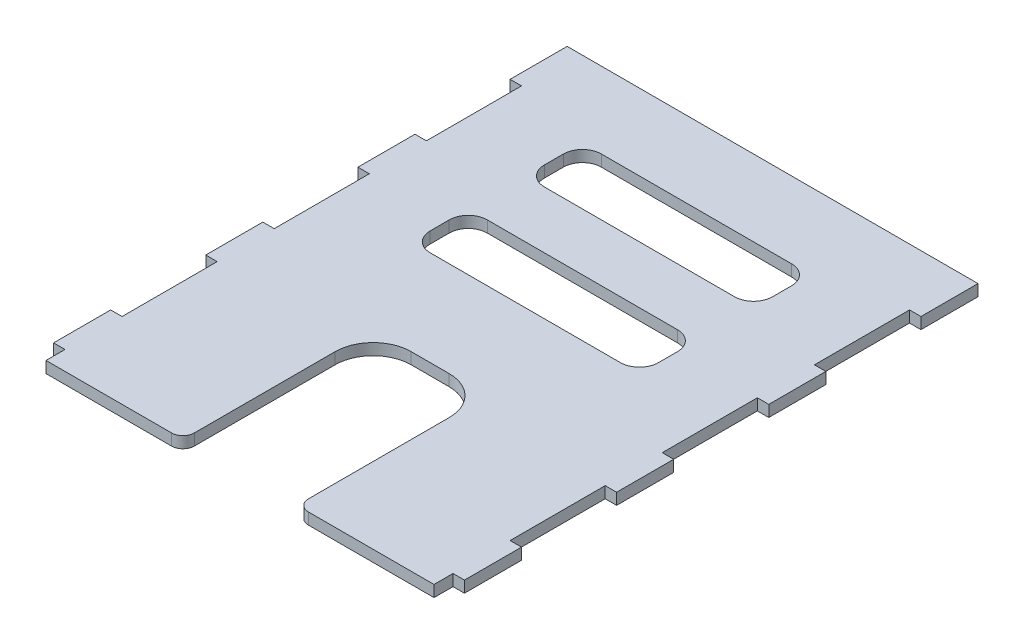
ISO-10303-21;
HEADER;
FILE_DESCRIPTION(('STEP AP214'),'2;1');
FILE_NAME('part.step','',(''),(''),'','','');
FILE_SCHEMA(('AUTOMOTIVE_DESIGN { 1 0 10303 214 1 1 1 1 }'));
ENDSEC;
DATA;
#1=APPLICATION_CONTEXT('core data for automotive mechanical design processes');
#2=APPLICATION_PROTOCOL_DEFINITION('international standard','automotive_design',2000,#1);
#3=PRODUCT_CONTEXT('',#1,'mechanical');
#4=PRODUCT('Part','Part','',(#3));
#5=PRODUCT_RELATED_PRODUCT_CATEGORY('part','',(#4));
#6=PRODUCT_DEFINITION_FORMATION('','',#4);
#7=PRODUCT_DEFINITION_CONTEXT('part definition',#1,'design');
#8=PRODUCT_DEFINITION('design','',#6,#7);
#9=PRODUCT_DEFINITION_SHAPE('','',#8);
#10=(LENGTH_UNIT() NAMED_UNIT(*) SI_UNIT(.MILLI.,.METRE.));
#11=(NAMED_UNIT(*) PLANE_ANGLE_UNIT() SI_UNIT($,.RADIAN.));
#12=(NAMED_UNIT(*) SI_UNIT($,.STERADIAN.) SOLID_ANGLE_UNIT());
#13=UNCERTAINTY_MEASURE_WITH_UNIT(LENGTH_MEASURE(1.E-05),#10,'distance_accuracy_value','');
#14=(GEOMETRIC_REPRESENTATION_CONTEXT(3) GLOBAL_UNCERTAINTY_ASSIGNED_CONTEXT((#13)) GLOBAL_UNIT_ASSIGNED_CONTEXT((#10,
#11,#12)) REPRESENTATION_CONTEXT('',''));
#15=CARTESIAN_POINT('',(0.,0.,0.));
#16=DIRECTION('',(0.,0.,1.));
#17=DIRECTION('',(1.,0.,0.));
#18=AXIS2_PLACEMENT_3D('',#15,#16,#17);
#19=CARTESIAN_POINT('',(0.,3.,0.));
#20=DIRECTION('',(0.,0.,-1.));
#21=DIRECTION('',(-1.,0.,0.));
#22=AXIS2_PLACEMENT_3D('',#19,#20,#21);
#23=PLANE('',#22);
#24=DIRECTION('',(1.,0.,0.));
#25=VECTOR('',#24,1.);
#26=CARTESIAN_POINT('',(0.,0.,0.));
#27=LINE('',#26,#25);
#28=CARTESIAN_POINT('',(0.,0.,0.));
#29=VERTEX_POINT('',#28);
#30=CARTESIAN_POINT('',(33.,0.,0.));
#31=VERTEX_POINT('',#30);
#32=EDGE_CURVE('E629',#29,#31,#27,.T.);
#33=ORIENTED_EDGE('',*,*,#32,.T.);
#34=DIRECTION('',(0.,1.,0.));
#35=VECTOR('',#34,1.);
#36=CARTESIAN_POINT('',(33.,3.,0.));
#37=LINE('',#36,#35);
#38=CARTESIAN_POINT('',(33.,3.,0.));
#39=VERTEX_POINT('',#38);
#40=EDGE_CURVE('E683',#31,#39,#37,.T.);
#41=ORIENTED_EDGE('',*,*,#40,.T.);
#42=DIRECTION('',(1.,0.,0.));
#43=VECTOR('',#42,1.);
#44=CARTESIAN_POINT('',(0.,3.,0.));
#45=LINE('',#44,#43);
#46=CARTESIAN_POINT('',(0.,3.,0.));
#47=VERTEX_POINT('',#46);
#48=EDGE_CURVE('E619',#47,#39,#45,.T.);
#49=ORIENTED_EDGE('',*,*,#48,.F.);
#50=DIRECTION('',(0.,-1.,0.));
#51=VECTOR('',#50,1.);
#52=CARTESIAN_POINT('',(0.,3.,0.));
#53=LINE('',#52,#51);
#54=EDGE_CURVE('E639',#47,#29,#53,.T.);
#55=ORIENTED_EDGE('',*,*,#54,.T.);
#56=EDGE_LOOP('',(#33,#41,#49,#55));
#57=FACE_BOUND('',#56,.T.);
#58=ADVANCED_FACE('F34',(#57),#23,.F.);
#59=CARTESIAN_POINT('',(0.,3.,-145.));
#60=DIRECTION('',(1.,0.,0.));
#61=DIRECTION('',(0.,0.,-1.));
#62=AXIS2_PLACEMENT_3D('',#59,#60,#61);
#63=PLANE('',#62);
#64=DIRECTION('',(0.,0.,1.));
#65=VECTOR('',#64,1.);
#66=CARTESIAN_POINT('',(0.,3.,-145.));
#67=LINE('',#66,#65);
#68=CARTESIAN_POINT('',(0.,3.,-125.));
#69=VERTEX_POINT('',#68);
#70=CARTESIAN_POINT('',(0.,3.,-100.));
#71=VERTEX_POINT('',#70);
#72=EDGE_CURVE('E408',#69,#71,#67,.T.);
#73=ORIENTED_EDGE('',*,*,#72,.F.);
#74=DIRECTION('',(0.,1.,0.));
#75=VECTOR('',#74,1.);
#76=CARTESIAN_POINT('',(0.,0.,-125.));
#77=LINE('',#76,#75);
#78=CARTESIAN_POINT('',(0.,0.,-125.));
#79=VERTEX_POINT('',#78);
#80=EDGE_CURVE('E406',#79,#69,#77,.T.);
#81=ORIENTED_EDGE('',*,*,#80,.F.);
#82=DIRECTION('',(0.,0.,1.));
#83=VECTOR('',#82,1.);
#84=CARTESIAN_POINT('',(0.,0.,-145.));
#85=LINE('',#84,#83);
#86=CARTESIAN_POINT('',(0.,0.,-100.));
#87=VERTEX_POINT('',#86);
#88=EDGE_CURVE('E388',#79,#87,#85,.T.);
#89=ORIENTED_EDGE('',*,*,#88,.T.);
#90=DIRECTION('',(0.,1.,0.));
#91=VECTOR('',#90,1.);
#92=CARTESIAN_POINT('',(0.,0.,-100.));
#93=LINE('',#92,#91);
#94=EDGE_CURVE('E453',#87,#71,#93,.T.);
#95=ORIENTED_EDGE('',*,*,#94,.T.);
#96=EDGE_LOOP('',(#73,#81,#89,#95));
#97=FACE_BOUND('',#96,.T.);
#98=ADVANCED_FACE('F407',(#97),#63,.F.);
#99=CARTESIAN_POINT('',(0.,3.,-85.));
#100=VERTEX_POINT('',#99);
#101=CARTESIAN_POINT('',(0.,3.,-60.));
#102=VERTEX_POINT('',#101);
#103=EDGE_CURVE('E617',#100,#102,#67,.T.);
#104=ORIENTED_EDGE('',*,*,#103,.F.);
#105=DIRECTION('',(0.,1.,0.));
#106=VECTOR('',#105,1.);
#107=CARTESIAN_POINT('',(0.,0.,-85.));
#108=LINE('',#107,#106);
#109=CARTESIAN_POINT('',(0.,0.,-85.));
#110=VERTEX_POINT('',#109);
#111=EDGE_CURVE('E440',#110,#100,#108,.T.);
#112=ORIENTED_EDGE('',*,*,#111,.F.);
#113=CARTESIAN_POINT('',(0.,0.,-60.));
#114=VERTEX_POINT('',#113);
#115=EDGE_CURVE('E402',#110,#114,#85,.T.);
#116=ORIENTED_EDGE('',*,*,#115,.T.);
#117=DIRECTION('',(0.,1.,0.));
#118=VECTOR('',#117,1.);
#119=CARTESIAN_POINT('',(0.,0.,-60.));
#120=LINE('',#119,#118);
#121=EDGE_CURVE('E480',#114,#102,#120,.T.);
#122=ORIENTED_EDGE('',*,*,#121,.T.);
#123=EDGE_LOOP('',(#104,#112,#116,#122));
#124=FACE_BOUND('',#123,.T.);
#125=ADVANCED_FACE('F869',(#124),#63,.F.);
#126=CARTESIAN_POINT('',(0.,3.,-45.));
#127=VERTEX_POINT('',#126);
#128=CARTESIAN_POINT('',(0.,3.,-20.));
#129=VERTEX_POINT('',#128);
#130=EDGE_CURVE('E882',#127,#129,#67,.T.);
#131=ORIENTED_EDGE('',*,*,#130,.F.);
#132=DIRECTION('',(0.,1.,0.));
#133=VECTOR('',#132,1.);
#134=CARTESIAN_POINT('',(0.,0.,-45.));
#135=LINE('',#134,#133);
#136=CARTESIAN_POINT('',(0.,0.,-45.));
#137=VERTEX_POINT('',#136);
#138=EDGE_CURVE('E467',#137,#127,#135,.T.);
#139=ORIENTED_EDGE('',*,*,#138,.F.);
#140=CARTESIAN_POINT('',(0.,0.,-20.));
#141=VERTEX_POINT('',#140);
#142=EDGE_CURVE('E862',#137,#141,#85,.T.);
#143=ORIENTED_EDGE('',*,*,#142,.T.);
#144=DIRECTION('',(0.,1.,0.));
#145=VECTOR('',#144,1.);
#146=CARTESIAN_POINT('',(0.,0.,-20.));
#147=LINE('',#146,#145);
#148=EDGE_CURVE('E494',#141,#129,#147,.T.);
#149=ORIENTED_EDGE('',*,*,#148,.T.);
#150=EDGE_LOOP('',(#131,#139,#143,#149));
#151=FACE_BOUND('',#150,.T.);
#152=ADVANCED_FACE('F893',(#151),#63,.F.);
#153=DIRECTION('',(0.,1.,0.));
#154=VECTOR('',#153,1.);
#155=CARTESIAN_POINT('',(0.,0.,-4.99999999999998));
#156=LINE('',#155,#154);
#157=CARTESIAN_POINT('',(0.,0.,-4.99999999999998));
#158=VERTEX_POINT('',#157);
#159=CARTESIAN_POINT('',(0.,3.,-4.99999999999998));
#160=VERTEX_POINT('',#159);
#161=EDGE_CURVE('E502',#158,#160,#156,.T.);
#162=ORIENTED_EDGE('',*,*,#161,.F.);
#163=EDGE_CURVE('E404',#158,#29,#85,.T.);
#164=ORIENTED_EDGE('',*,*,#163,.T.);
#165=ORIENTED_EDGE('',*,*,#54,.F.);
#166=EDGE_CURVE('E618',#160,#47,#67,.T.);
#167=ORIENTED_EDGE('',*,*,#166,.F.);
#168=EDGE_LOOP('',(#162,#164,#165,#167));
#169=FACE_BOUND('',#168,.T.);
#170=ADVANCED_FACE('F860',(#169),#63,.F.);
#171=CARTESIAN_POINT('',(102.,3.,0.));
#172=DIRECTION('',(-1.,0.,0.));
#173=DIRECTION('',(0.,0.,1.));
#174=AXIS2_PLACEMENT_3D('',#171,#172,#173);
#175=PLANE('',#174);
#176=DIRECTION('',(0.,0.,-1.));
#177=VECTOR('',#176,1.);
#178=CARTESIAN_POINT('',(102.,3.,0.));
#179=LINE('',#178,#177);
#180=CARTESIAN_POINT('',(102.,3.,-60.));
#181=VERTEX_POINT('',#180);
#182=CARTESIAN_POINT('',(102.,3.,-85.));
#183=VERTEX_POINT('',#182);
#184=EDGE_CURVE('E627',#181,#183,#179,.T.);
#185=ORIENTED_EDGE('',*,*,#184,.F.);
#186=DIRECTION('',(0.,1.,0.));
#187=VECTOR('',#186,1.);
#188=CARTESIAN_POINT('',(102.,0.,-60.));
#189=LINE('',#188,#187);
#190=CARTESIAN_POINT('',(102.,0.,-60.));
#191=VERTEX_POINT('',#190);
#192=EDGE_CURVE('E529',#191,#181,#189,.T.);
#193=ORIENTED_EDGE('',*,*,#192,.F.);
#194=DIRECTION('',(0.,0.,-1.));
#195=VECTOR('',#194,1.);
#196=CARTESIAN_POINT('',(102.,0.,0.));
#197=LINE('',#196,#195);
#198=CARTESIAN_POINT('',(102.,0.,-85.));
#199=VERTEX_POINT('',#198);
#200=EDGE_CURVE('E636',#191,#199,#197,.T.);
#201=ORIENTED_EDGE('',*,*,#200,.T.);
#202=DIRECTION('',(0.,1.,0.));
#203=VECTOR('',#202,1.);
#204=CARTESIAN_POINT('',(102.,0.,-85.));
#205=LINE('',#204,#203);
#206=EDGE_CURVE('E548',#199,#183,#205,.T.);
#207=ORIENTED_EDGE('',*,*,#206,.T.);
#208=EDGE_LOOP('',(#185,#193,#201,#207));
#209=FACE_BOUND('',#208,.T.);
#210=ADVANCED_FACE('F924',(#209),#175,.F.);
#211=CARTESIAN_POINT('',(102.,3.,-100.));
#212=VERTEX_POINT('',#211);
#213=CARTESIAN_POINT('',(102.,3.,-125.));
#214=VERTEX_POINT('',#213);
#215=EDGE_CURVE('E622',#212,#214,#179,.T.);
#216=ORIENTED_EDGE('',*,*,#215,.F.);
#217=DIRECTION('',(0.,1.,0.));
#218=VECTOR('',#217,1.);
#219=CARTESIAN_POINT('',(102.,0.,-100.));
#220=LINE('',#219,#218);
#221=CARTESIAN_POINT('',(102.,0.,-100.));
#222=VERTEX_POINT('',#221);
#223=EDGE_CURVE('E556',#222,#212,#220,.T.);
#224=ORIENTED_EDGE('',*,*,#223,.F.);
#225=CARTESIAN_POINT('',(102.,0.,-125.));
#226=VERTEX_POINT('',#225);
#227=EDGE_CURVE('E632',#222,#226,#197,.T.);
#228=ORIENTED_EDGE('',*,*,#227,.T.);
#229=DIRECTION('',(0.,1.,0.));
#230=VECTOR('',#229,1.);
#231=CARTESIAN_POINT('',(102.,0.,-125.));
#232=LINE('',#231,#230);
#233=EDGE_CURVE('E602',#226,#214,#232,.T.);
#234=ORIENTED_EDGE('',*,*,#233,.T.);
#235=EDGE_LOOP('',(#216,#224,#228,#234));
#236=FACE_BOUND('',#235,.T.);
#237=ADVANCED_FACE('F925',(#236),#175,.F.);
#238=CARTESIAN_POINT('',(102.,0.,0.));
#239=VERTEX_POINT('',#238);
#240=CARTESIAN_POINT('',(102.,0.,-4.99999999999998));
#241=VERTEX_POINT('',#240);
#242=EDGE_CURVE('E633',#239,#241,#197,.T.);
#243=ORIENTED_EDGE('',*,*,#242,.T.);
#244=DIRECTION('',(0.,1.,0.));
#245=VECTOR('',#244,1.);
#246=CARTESIAN_POINT('',(102.,0.,-4.99999999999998));
#247=LINE('',#246,#245);
#248=CARTESIAN_POINT('',(102.,3.,-4.99999999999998));
#249=VERTEX_POINT('',#248);
#250=EDGE_CURVE('E584',#241,#249,#247,.T.);
#251=ORIENTED_EDGE('',*,*,#250,.T.);
#252=CARTESIAN_POINT('',(102.,3.,0.));
#253=VERTEX_POINT('',#252);
#254=EDGE_CURVE('E623',#253,#249,#179,.T.);
#255=ORIENTED_EDGE('',*,*,#254,.F.);
#256=DIRECTION('',(0.,-1.,0.));
#257=VECTOR('',#256,1.);
#258=CARTESIAN_POINT('',(102.,3.,0.));
#259=LINE('',#258,#257);
#260=EDGE_CURVE('E625',#253,#239,#259,.T.);
#261=ORIENTED_EDGE('',*,*,#260,.T.);
#262=EDGE_LOOP('',(#243,#251,#255,#261));
#263=FACE_BOUND('',#262,.T.);
#264=ADVANCED_FACE('F917',(#263),#175,.F.);
#265=CARTESIAN_POINT('',(69.,3.,0.));
#266=VERTEX_POINT('',#265);
#267=EDGE_CURVE('E616',#266,#253,#45,.T.);
#268=ORIENTED_EDGE('',*,*,#267,.F.);
#269=DIRECTION('',(0.,1.,0.));
#270=VECTOR('',#269,1.);
#271=CARTESIAN_POINT('',(69.,3.,0.));
#272=LINE('',#271,#270);
#273=CARTESIAN_POINT('',(69.,0.,0.));
#274=VERTEX_POINT('',#273);
#275=EDGE_CURVE('E677',#266,#274,#272,.F.);
#276=ORIENTED_EDGE('',*,*,#275,.T.);
#277=EDGE_CURVE('E401',#274,#239,#27,.T.);
#278=ORIENTED_EDGE('',*,*,#277,.T.);
#279=ORIENTED_EDGE('',*,*,#260,.F.);
#280=EDGE_LOOP('',(#268,#276,#278,#279));
#281=FACE_BOUND('',#280,.T.);
#282=ADVANCED_FACE('F909',(#281),#23,.F.);
#283=CARTESIAN_POINT('',(102.,0.,-20.));
#284=VERTEX_POINT('',#283);
#285=CARTESIAN_POINT('',(102.,0.,-45.));
#286=VERTEX_POINT('',#285);
#287=EDGE_CURVE('E635',#284,#286,#197,.T.);
#288=ORIENTED_EDGE('',*,*,#287,.T.);
#289=DIRECTION('',(0.,1.,0.));
#290=VECTOR('',#289,1.);
#291=CARTESIAN_POINT('',(102.,0.,-45.));
#292=LINE('',#291,#290);
#293=CARTESIAN_POINT('',(102.,3.,-45.));
#294=VERTEX_POINT('',#293);
#295=EDGE_CURVE('E521',#286,#294,#292,.T.);
#296=ORIENTED_EDGE('',*,*,#295,.T.);
#297=CARTESIAN_POINT('',(102.,3.,-20.));
#298=VERTEX_POINT('',#297);
#299=EDGE_CURVE('E626',#298,#294,#179,.T.);
#300=ORIENTED_EDGE('',*,*,#299,.F.);
#301=DIRECTION('',(0.,1.,0.));
#302=VECTOR('',#301,1.);
#303=CARTESIAN_POINT('',(102.,0.,-20.));
#304=LINE('',#303,#302);
#305=EDGE_CURVE('E587',#284,#298,#304,.T.);
#306=ORIENTED_EDGE('',*,*,#305,.F.);
#307=EDGE_LOOP('',(#288,#296,#300,#306));
#308=FACE_BOUND('',#307,.T.);
#309=ADVANCED_FACE('F916',(#308),#175,.F.);
#310=CARTESIAN_POINT('',(0.,3.,0.));
#311=DIRECTION('',(0.,1.,0.));
#312=DIRECTION('',(0.,0.,1.));
#313=AXIS2_PLACEMENT_3D('',#310,#311,#312);
#314=PLANE('',#313);
#315=DIRECTION('',(-1.,0.,0.));
#316=VECTOR('',#315,1.);
#317=CARTESIAN_POINT('',(102.,3.,-140.));
#318=LINE('',#317,#316);
#319=CARTESIAN_POINT('',(105.,3.,-140.));
#320=VERTEX_POINT('',#319);
#321=CARTESIAN_POINT('',(-3.,3.,-140.));
#322=VERTEX_POINT('',#321);
#323=EDGE_CURVE('E597',#320,#322,#318,.T.);
#324=ORIENTED_EDGE('',*,*,#323,.T.);
#325=DIRECTION('',(0.,0.,1.));
#326=VECTOR('',#325,1.);
#327=CARTESIAN_POINT('',(-3.,3.,-140.));
#328=LINE('',#327,#326);
#329=CARTESIAN_POINT('',(-3.,3.,-125.));
#330=VERTEX_POINT('',#329);
#331=EDGE_CURVE('E417',#322,#330,#328,.T.);
#332=ORIENTED_EDGE('',*,*,#331,.T.);
#333=DIRECTION('',(1.,0.,0.));
#334=VECTOR('',#333,1.);
#335=CARTESIAN_POINT('',(-3.,3.,-125.));
#336=LINE('',#335,#334);
#337=EDGE_CURVE('E421',#330,#69,#336,.T.);
#338=ORIENTED_EDGE('',*,*,#337,.T.);
#339=ORIENTED_EDGE('',*,*,#72,.T.);
#340=DIRECTION('',(-1.,0.,0.));
#341=VECTOR('',#340,1.);
#342=CARTESIAN_POINT('',(-3.,3.,-100.));
#343=LINE('',#342,#341);
#344=CARTESIAN_POINT('',(-3.,3.,-100.));
#345=VERTEX_POINT('',#344);
#346=EDGE_CURVE('E443',#71,#345,#343,.T.);
#347=ORIENTED_EDGE('',*,*,#346,.T.);
#348=DIRECTION('',(0.,0.,1.));
#349=VECTOR('',#348,1.);
#350=CARTESIAN_POINT('',(-3.,3.,-85.));
#351=LINE('',#350,#349);
#352=CARTESIAN_POINT('',(-3.,3.,-85.));
#353=VERTEX_POINT('',#352);
#354=EDGE_CURVE('E435',#345,#353,#351,.T.);
#355=ORIENTED_EDGE('',*,*,#354,.T.);
#356=DIRECTION('',(1.,0.,0.));
#357=VECTOR('',#356,1.);
#358=CARTESIAN_POINT('',(0.,3.,-85.));
#359=LINE('',#358,#357);
#360=EDGE_CURVE('E429',#353,#100,#359,.T.);
#361=ORIENTED_EDGE('',*,*,#360,.T.);
#362=ORIENTED_EDGE('',*,*,#103,.T.);
#363=DIRECTION('',(-1.,0.,0.));
#364=VECTOR('',#363,1.);
#365=CARTESIAN_POINT('',(-3.,3.,-60.));
#366=LINE('',#365,#364);
#367=CARTESIAN_POINT('',(-3.,3.,-60.));
#368=VERTEX_POINT('',#367);
#369=EDGE_CURVE('E470',#102,#368,#366,.T.);
#370=ORIENTED_EDGE('',*,*,#369,.T.);
#371=DIRECTION('',(0.,0.,1.));
#372=VECTOR('',#371,1.);
#373=CARTESIAN_POINT('',(-3.,3.,-45.));
#374=LINE('',#373,#372);
#375=CARTESIAN_POINT('',(-3.,3.,-45.));
#376=VERTEX_POINT('',#375);
#377=EDGE_CURVE('E461',#368,#376,#374,.T.);
#378=ORIENTED_EDGE('',*,*,#377,.T.);
#379=DIRECTION('',(1.,0.,0.));
#380=VECTOR('',#379,1.);
#381=CARTESIAN_POINT('',(0.,3.,-45.));
#382=LINE('',#381,#380);
#383=EDGE_CURVE('E450',#376,#127,#382,.T.);
#384=ORIENTED_EDGE('',*,*,#383,.T.);
#385=ORIENTED_EDGE('',*,*,#130,.T.);
#386=DIRECTION('',(-1.,0.,0.));
#387=VECTOR('',#386,1.);
#388=CARTESIAN_POINT('',(-3.,3.,-20.));
#389=LINE('',#388,#387);
#390=CARTESIAN_POINT('',(-3.,3.,-20.));
#391=VERTEX_POINT('',#390);
#392=EDGE_CURVE('E477',#129,#391,#389,.T.);
#393=ORIENTED_EDGE('',*,*,#392,.T.);
#394=DIRECTION('',(0.,0.,1.));
#395=VECTOR('',#394,1.);
#396=CARTESIAN_POINT('',(-3.,3.,-4.99999999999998));
#397=LINE('',#396,#395);
#398=CARTESIAN_POINT('',(-3.,3.,-4.99999999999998));
#399=VERTEX_POINT('',#398);
#400=EDGE_CURVE('E497',#391,#399,#397,.T.);
#401=ORIENTED_EDGE('',*,*,#400,.T.);
#402=DIRECTION('',(1.,0.,0.));
#403=VECTOR('',#402,1.);
#404=CARTESIAN_POINT('',(0.,3.,-4.99999999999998));
#405=LINE('',#404,#403);
#406=EDGE_CURVE('E489',#399,#160,#405,.T.);
#407=ORIENTED_EDGE('',*,*,#406,.T.);
#408=ORIENTED_EDGE('',*,*,#166,.T.);
#409=ORIENTED_EDGE('',*,*,#48,.T.);
#410=CARTESIAN_POINT('',(33.,3.,-3.));
#411=DIRECTION('',(0.,1.,0.));
#412=DIRECTION('',(0.,0.,1.));
#413=AXIS2_PLACEMENT_3D('',#410,#411,#412);
#414=CIRCLE('',#413,3.);
#415=CARTESIAN_POINT('',(36.,3.,-3.));
#416=VERTEX_POINT('',#415);
#417=EDGE_CURVE('E673',#39,#416,#414,.T.);
#418=ORIENTED_EDGE('',*,*,#417,.T.);
#419=DIRECTION('',(0.,0.,1.));
#420=VECTOR('',#419,1.);
#421=CARTESIAN_POINT('',(36.,3.,0.));
#422=LINE('',#421,#420);
#423=CARTESIAN_POINT('',(36.,3.,-40.));
#424=VERTEX_POINT('',#423);
#425=EDGE_CURVE('E424',#424,#416,#422,.T.);
#426=ORIENTED_EDGE('',*,*,#425,.F.);
#427=CARTESIAN_POINT('',(46.,3.,-40.));
#428=DIRECTION('',(0.,1.,0.));
#429=DIRECTION('',(0.,0.,1.));
#430=AXIS2_PLACEMENT_3D('',#427,#428,#429);
#431=CIRCLE('',#430,10.);
#432=CARTESIAN_POINT('',(46.,3.,-50.));
#433=VERTEX_POINT('',#432);
#434=EDGE_CURVE('E666',#424,#433,#431,.F.);
#435=ORIENTED_EDGE('',*,*,#434,.T.);
#436=DIRECTION('',(-1.,0.,0.));
#437=VECTOR('',#436,1.);
#438=CARTESIAN_POINT('',(36.,3.,-50.));
#439=LINE('',#438,#437);
#440=CARTESIAN_POINT('',(56.,3.,-50.));
#441=VERTEX_POINT('',#440);
#442=EDGE_CURVE('E835',#441,#433,#439,.T.);
#443=ORIENTED_EDGE('',*,*,#442,.F.);
#444=CARTESIAN_POINT('',(56.,3.,-40.));
#445=DIRECTION('',(0.,1.,0.));
#446=DIRECTION('',(0.,0.,1.));
#447=AXIS2_PLACEMENT_3D('',#444,#445,#446);
#448=CIRCLE('',#447,10.);
#449=CARTESIAN_POINT('',(66.,3.,-40.));
#450=VERTEX_POINT('',#449);
#451=EDGE_CURVE('E661',#441,#450,#448,.F.);
#452=ORIENTED_EDGE('',*,*,#451,.T.);
#453=DIRECTION('',(0.,0.,-1.));
#454=VECTOR('',#453,1.);
#455=CARTESIAN_POINT('',(66.,3.,-50.));
#456=LINE('',#455,#454);
#457=CARTESIAN_POINT('',(66.,3.,-3.));
#458=VERTEX_POINT('',#457);
#459=EDGE_CURVE('E787',#458,#450,#456,.T.);
#460=ORIENTED_EDGE('',*,*,#459,.F.);
#461=CARTESIAN_POINT('',(69.,3.,-3.));
#462=DIRECTION('',(0.,1.,0.));
#463=DIRECTION('',(0.,0.,1.));
#464=AXIS2_PLACEMENT_3D('',#461,#462,#463);
#465=CIRCLE('',#464,3.);
#466=EDGE_CURVE('E675',#458,#266,#465,.T.);
#467=ORIENTED_EDGE('',*,*,#466,.T.);
#468=ORIENTED_EDGE('',*,*,#267,.T.);
#469=ORIENTED_EDGE('',*,*,#254,.T.);
#470=DIRECTION('',(1.,0.,0.));
#471=VECTOR('',#470,1.);
#472=CARTESIAN_POINT('',(102.,3.,-4.99999999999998));
#473=LINE('',#472,#471);
#474=CARTESIAN_POINT('',(105.,3.,-4.99999999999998));
#475=VERTEX_POINT('',#474);
#476=EDGE_CURVE('E559',#249,#475,#473,.T.);
#477=ORIENTED_EDGE('',*,*,#476,.T.);
#478=DIRECTION('',(0.,0.,-1.));
#479=VECTOR('',#478,1.);
#480=CARTESIAN_POINT('',(105.,3.,-4.99999999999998));
#481=LINE('',#480,#479);
#482=CARTESIAN_POINT('',(105.,3.,-20.));
#483=VERTEX_POINT('',#482);
#484=EDGE_CURVE('E579',#475,#483,#481,.T.);
#485=ORIENTED_EDGE('',*,*,#484,.T.);
#486=DIRECTION('',(-1.,0.,0.));
#487=VECTOR('',#486,1.);
#488=CARTESIAN_POINT('',(105.,3.,-20.));
#489=LINE('',#488,#487);
#490=EDGE_CURVE('E570',#483,#298,#489,.T.);
#491=ORIENTED_EDGE('',*,*,#490,.T.);
#492=ORIENTED_EDGE('',*,*,#299,.T.);
#493=DIRECTION('',(1.,0.,0.));
#494=VECTOR('',#493,1.);
#495=CARTESIAN_POINT('',(102.,3.,-45.));
#496=LINE('',#495,#494);
#497=CARTESIAN_POINT('',(105.,3.,-45.));
#498=VERTEX_POINT('',#497);
#499=EDGE_CURVE('E504',#294,#498,#496,.T.);
#500=ORIENTED_EDGE('',*,*,#499,.T.);
#501=DIRECTION('',(0.,0.,-1.));
#502=VECTOR('',#501,1.);
#503=CARTESIAN_POINT('',(105.,3.,-45.));
#504=LINE('',#503,#502);
#505=CARTESIAN_POINT('',(105.,3.,-60.));
#506=VERTEX_POINT('',#505);
#507=EDGE_CURVE('E524',#498,#506,#504,.T.);
#508=ORIENTED_EDGE('',*,*,#507,.T.);
#509=DIRECTION('',(-1.,0.,0.));
#510=VECTOR('',#509,1.);
#511=CARTESIAN_POINT('',(105.,3.,-60.));
#512=LINE('',#511,#510);
#513=EDGE_CURVE('E515',#506,#181,#512,.T.);
#514=ORIENTED_EDGE('',*,*,#513,.T.);
#515=ORIENTED_EDGE('',*,*,#184,.T.);
#516=DIRECTION('',(1.,0.,0.));
#517=VECTOR('',#516,1.);
#518=CARTESIAN_POINT('',(102.,3.,-85.));
#519=LINE('',#518,#517);
#520=CARTESIAN_POINT('',(105.,3.,-85.));
#521=VERTEX_POINT('',#520);
#522=EDGE_CURVE('E532',#183,#521,#519,.T.);
#523=ORIENTED_EDGE('',*,*,#522,.T.);
#524=DIRECTION('',(0.,0.,-1.));
#525=VECTOR('',#524,1.);
#526=CARTESIAN_POINT('',(105.,3.,-85.));
#527=LINE('',#526,#525);
#528=CARTESIAN_POINT('',(105.,3.,-100.));
#529=VERTEX_POINT('',#528);
#530=EDGE_CURVE('E551',#521,#529,#527,.T.);
#531=ORIENTED_EDGE('',*,*,#530,.T.);
#532=DIRECTION('',(-1.,0.,0.));
#533=VECTOR('',#532,1.);
#534=CARTESIAN_POINT('',(105.,3.,-100.));
#535=LINE('',#534,#533);
#536=EDGE_CURVE('E542',#529,#212,#535,.T.);
#537=ORIENTED_EDGE('',*,*,#536,.T.);
#538=ORIENTED_EDGE('',*,*,#215,.T.);
#539=DIRECTION('',(1.,0.,0.));
#540=VECTOR('',#539,1.);
#541=CARTESIAN_POINT('',(105.,3.,-125.));
#542=LINE('',#541,#540);
#543=CARTESIAN_POINT('',(105.,3.,-125.));
#544=VERTEX_POINT('',#543);
#545=EDGE_CURVE('E586',#214,#544,#542,.T.);
#546=ORIENTED_EDGE('',*,*,#545,.T.);
#547=DIRECTION('',(0.,0.,-1.));
#548=VECTOR('',#547,1.);
#549=CARTESIAN_POINT('',(105.,3.,-140.));
#550=LINE('',#549,#548);
#551=EDGE_CURVE('E605',#544,#320,#550,.T.);
#552=ORIENTED_EDGE('',*,*,#551,.T.);
#553=EDGE_LOOP('',(#324,#332,#338,#339,#347,#355,#361,#362,#370,#378,#384,#385,#393,#401,#407,
#408,#409,#418,#426,#435,#443,#452,#460,#467,#468,#469,#477,#485,#491,#492,#500,#508,#514,#515,
#523,#531,#537,#538,#546,#552));
#554=FACE_BOUND('',#553,.T.);
#555=DIRECTION('',(0.,0.,1.));
#556=VECTOR('',#555,1.);
#557=CARTESIAN_POINT('',(21.,3.,-105.));
#558=LINE('',#557,#556);
#559=CARTESIAN_POINT('',(21.,3.,-115.));
#560=VERTEX_POINT('',#559);
#561=CARTESIAN_POINT('',(21.,3.,-110.));
#562=VERTEX_POINT('',#561);
#563=EDGE_CURVE('E782',#560,#562,#558,.T.);
#564=ORIENTED_EDGE('',*,*,#563,.F.);
#565=CARTESIAN_POINT('',(26.,3.,-115.));
#566=DIRECTION('',(0.,1.,0.));
#567=DIRECTION('',(0.,0.,1.));
#568=AXIS2_PLACEMENT_3D('',#565,#566,#567);
#569=CIRCLE('',#568,5.);
#570=CARTESIAN_POINT('',(26.,3.,-120.));
#571=VERTEX_POINT('',#570);
#572=EDGE_CURVE('E42',#560,#571,#569,.F.);
#573=ORIENTED_EDGE('',*,*,#572,.T.);
#574=DIRECTION('',(-1.,0.,0.));
#575=VECTOR('',#574,1.);
#576=CARTESIAN_POINT('',(21.,3.,-120.));
#577=LINE('',#576,#575);
#578=CARTESIAN_POINT('',(76.,3.,-120.));
#579=VERTEX_POINT('',#578);
#580=EDGE_CURVE('E780',#579,#571,#577,.T.);
#581=ORIENTED_EDGE('',*,*,#580,.F.);
#582=CARTESIAN_POINT('',(76.,3.,-115.));
#583=DIRECTION('',(0.,1.,0.));
#584=DIRECTION('',(0.,0.,1.));
#585=AXIS2_PLACEMENT_3D('',#582,#583,#584);
#586=CIRCLE('',#585,5.);
#587=CARTESIAN_POINT('',(81.,3.,-115.));
#588=VERTEX_POINT('',#587);
#589=EDGE_CURVE('E773',#579,#588,#586,.F.);
#590=ORIENTED_EDGE('',*,*,#589,.T.);
#591=DIRECTION('',(0.,0.,-1.));
#592=VECTOR('',#591,1.);
#593=CARTESIAN_POINT('',(81.,3.,-120.));
#594=LINE('',#593,#592);
#595=CARTESIAN_POINT('',(81.,3.,-110.));
#596=VERTEX_POINT('',#595);
#597=EDGE_CURVE('E788',#596,#588,#594,.T.);
#598=ORIENTED_EDGE('',*,*,#597,.F.);
#599=CARTESIAN_POINT('',(76.,3.,-110.));
#600=DIRECTION('',(0.,1.,0.));
#601=DIRECTION('',(0.,0.,1.));
#602=AXIS2_PLACEMENT_3D('',#599,#600,#601);
#603=CIRCLE('',#602,5.);
#604=CARTESIAN_POINT('',(76.,3.,-105.));
#605=VERTEX_POINT('',#604);
#606=EDGE_CURVE('E769',#596,#605,#603,.F.);
#607=ORIENTED_EDGE('',*,*,#606,.T.);
#608=DIRECTION('',(1.,0.,0.));
#609=VECTOR('',#608,1.);
#610=CARTESIAN_POINT('',(81.,3.,-105.));
#611=LINE('',#610,#609);
#612=CARTESIAN_POINT('',(26.,3.,-105.));
#613=VERTEX_POINT('',#612);
#614=EDGE_CURVE('E807',#613,#605,#611,.T.);
#615=ORIENTED_EDGE('',*,*,#614,.F.);
#616=CARTESIAN_POINT('',(26.,3.,-110.));
#617=DIRECTION('',(0.,1.,0.));
#618=DIRECTION('',(0.,0.,1.));
#619=AXIS2_PLACEMENT_3D('',#616,#617,#618);
#620=CIRCLE('',#619,5.);
#621=EDGE_CURVE('E765',#613,#562,#620,.F.);
#622=ORIENTED_EDGE('',*,*,#621,.T.);
#623=EDGE_LOOP('',(#564,#573,#581,#590,#598,#607,#615,#622));
#624=FACE_BOUND('',#623,.T.);
#625=DIRECTION('',(-1.,0.,0.));
#626=VECTOR('',#625,1.);
#627=CARTESIAN_POINT('',(81.,3.,-90.));
#628=LINE('',#627,#626);
#629=CARTESIAN_POINT('',(76.,3.,-90.));
#630=VERTEX_POINT('',#629);
#631=CARTESIAN_POINT('',(26.,3.,-90.));
#632=VERTEX_POINT('',#631);
#633=EDGE_CURVE('E823',#630,#632,#628,.T.);
#634=ORIENTED_EDGE('',*,*,#633,.F.);
#635=CARTESIAN_POINT('',(76.,3.,-85.));
#636=DIRECTION('',(0.,1.,0.));
#637=DIRECTION('',(0.,0.,1.));
#638=AXIS2_PLACEMENT_3D('',#635,#636,#637);
#639=CIRCLE('',#638,5.);
#640=CARTESIAN_POINT('',(81.,3.,-85.));
#641=VERTEX_POINT('',#640);
#642=EDGE_CURVE('E757',#630,#641,#639,.F.);
#643=ORIENTED_EDGE('',*,*,#642,.T.);
#644=DIRECTION('',(0.,0.,-1.));
#645=VECTOR('',#644,1.);
#646=CARTESIAN_POINT('',(81.,3.,-75.));
#647=LINE('',#646,#645);
#648=CARTESIAN_POINT('',(81.,3.,-80.));
#649=VERTEX_POINT('',#648);
#650=EDGE_CURVE('E832',#649,#641,#647,.T.);
#651=ORIENTED_EDGE('',*,*,#650,.F.);
#652=CARTESIAN_POINT('',(76.,3.,-80.));
#653=DIRECTION('',(0.,1.,0.));
#654=DIRECTION('',(0.,0.,1.));
#655=AXIS2_PLACEMENT_3D('',#652,#653,#654);
#656=CIRCLE('',#655,5.);
#657=CARTESIAN_POINT('',(76.,3.,-75.));
#658=VERTEX_POINT('',#657);
#659=EDGE_CURVE('E753',#649,#658,#656,.F.);
#660=ORIENTED_EDGE('',*,*,#659,.T.);
#661=DIRECTION('',(1.,0.,0.));
#662=VECTOR('',#661,1.);
#663=CARTESIAN_POINT('',(21.,3.,-75.));
#664=LINE('',#663,#662);
#665=CARTESIAN_POINT('',(26.,3.,-75.));
#666=VERTEX_POINT('',#665);
#667=EDGE_CURVE('E829',#666,#658,#664,.T.);
#668=ORIENTED_EDGE('',*,*,#667,.F.);
#669=CARTESIAN_POINT('',(26.,3.,-80.));
#670=DIRECTION('',(0.,1.,0.));
#671=DIRECTION('',(0.,0.,1.));
#672=AXIS2_PLACEMENT_3D('',#669,#670,#671);
#673=CIRCLE('',#672,5.);
#674=CARTESIAN_POINT('',(21.,3.,-80.));
#675=VERTEX_POINT('',#674);
#676=EDGE_CURVE('E749',#666,#675,#673,.F.);
#677=ORIENTED_EDGE('',*,*,#676,.T.);
#678=DIRECTION('',(0.,0.,1.));
#679=VECTOR('',#678,1.);
#680=CARTESIAN_POINT('',(21.,3.,-90.));
#681=LINE('',#680,#679);
#682=CARTESIAN_POINT('',(21.,3.,-85.));
#683=VERTEX_POINT('',#682);
#684=EDGE_CURVE('E826',#683,#675,#681,.T.);
#685=ORIENTED_EDGE('',*,*,#684,.F.);
#686=CARTESIAN_POINT('',(26.,3.,-85.));
#687=DIRECTION('',(0.,1.,0.));
#688=DIRECTION('',(0.,0.,1.));
#689=AXIS2_PLACEMENT_3D('',#686,#687,#688);
#690=CIRCLE('',#689,5.);
#691=EDGE_CURVE('E761',#683,#632,#690,.F.);
#692=ORIENTED_EDGE('',*,*,#691,.T.);
#693=EDGE_LOOP('',(#634,#643,#651,#660,#668,#677,#685,#692));
#694=FACE_BOUND('',#693,.T.);
#695=ADVANCED_FACE('F778',(#554,#624,#694),#314,.T.);
#696=CARTESIAN_POINT('',(0.,0.,0.));
#697=DIRECTION('',(0.,1.,0.));
#698=DIRECTION('',(0.,0.,1.));
#699=AXIS2_PLACEMENT_3D('',#696,#697,#698);
#700=PLANE('',#699);
#701=DIRECTION('',(0.,0.,-1.));
#702=VECTOR('',#701,1.);
#703=CARTESIAN_POINT('',(81.,0.,0.));
#704=LINE('',#703,#702);
#705=CARTESIAN_POINT('',(81.,0.,-110.));
#706=VERTEX_POINT('',#705);
#707=CARTESIAN_POINT('',(81.,0.,-115.));
#708=VERTEX_POINT('',#707);
#709=EDGE_CURVE('E703',#706,#708,#704,.T.);
#710=ORIENTED_EDGE('',*,*,#709,.T.);
#711=CARTESIAN_POINT('',(76.,0.,-115.));
#712=DIRECTION('',(0.,1.,0.));
#713=DIRECTION('',(0.,0.,1.));
#714=AXIS2_PLACEMENT_3D('',#711,#712,#713);
#715=CIRCLE('',#714,5.);
#716=CARTESIAN_POINT('',(76.,0.,-120.));
#717=VERTEX_POINT('',#716);
#718=EDGE_CURVE('E56',#708,#717,#715,.T.);
#719=ORIENTED_EDGE('',*,*,#718,.T.);
#720=DIRECTION('',(-1.,0.,0.));
#721=VECTOR('',#720,1.);
#722=CARTESIAN_POINT('',(0.,0.,-120.));
#723=LINE('',#722,#721);
#724=CARTESIAN_POINT('',(26.,0.,-120.));
#725=VERTEX_POINT('',#724);
#726=EDGE_CURVE('E705',#717,#725,#723,.T.);
#727=ORIENTED_EDGE('',*,*,#726,.T.);
#728=CARTESIAN_POINT('',(26.,0.,-115.));
#729=DIRECTION('',(0.,1.,0.));
#730=DIRECTION('',(0.,0.,1.));
#731=AXIS2_PLACEMENT_3D('',#728,#729,#730);
#732=CIRCLE('',#731,5.);
#733=CARTESIAN_POINT('',(21.,0.,-115.));
#734=VERTEX_POINT('',#733);
#735=EDGE_CURVE('E11',#725,#734,#732,.T.);
#736=ORIENTED_EDGE('',*,*,#735,.T.);
#737=DIRECTION('',(0.,0.,1.));
#738=VECTOR('',#737,1.);
#739=CARTESIAN_POINT('',(21.,0.,0.));
#740=LINE('',#739,#738);
#741=CARTESIAN_POINT('',(21.,0.,-110.));
#742=VERTEX_POINT('',#741);
#743=EDGE_CURVE('E707',#734,#742,#740,.T.);
#744=ORIENTED_EDGE('',*,*,#743,.T.);
#745=CARTESIAN_POINT('',(26.,0.,-110.));
#746=DIRECTION('',(0.,1.,0.));
#747=DIRECTION('',(0.,0.,1.));
#748=AXIS2_PLACEMENT_3D('',#745,#746,#747);
#749=CIRCLE('',#748,5.);
#750=CARTESIAN_POINT('',(26.,0.,-105.));
#751=VERTEX_POINT('',#750);
#752=EDGE_CURVE('E767',#742,#751,#749,.T.);
#753=ORIENTED_EDGE('',*,*,#752,.T.);
#754=DIRECTION('',(1.,0.,0.));
#755=VECTOR('',#754,1.);
#756=CARTESIAN_POINT('',(0.,0.,-105.));
#757=LINE('',#756,#755);
#758=CARTESIAN_POINT('',(76.,0.,-105.));
#759=VERTEX_POINT('',#758);
#760=EDGE_CURVE('E700',#751,#759,#757,.T.);
#761=ORIENTED_EDGE('',*,*,#760,.T.);
#762=CARTESIAN_POINT('',(76.,0.,-110.));
#763=DIRECTION('',(0.,1.,0.));
#764=DIRECTION('',(0.,0.,1.));
#765=AXIS2_PLACEMENT_3D('',#762,#763,#764);
#766=CIRCLE('',#765,5.);
#767=EDGE_CURVE('E771',#759,#706,#766,.T.);
#768=ORIENTED_EDGE('',*,*,#767,.T.);
#769=EDGE_LOOP('',(#710,#719,#727,#736,#744,#753,#761,#768));
#770=FACE_BOUND('',#769,.T.);
#771=DIRECTION('',(1.,0.,0.));
#772=VECTOR('',#771,1.);
#773=CARTESIAN_POINT('',(0.,0.,-75.));
#774=LINE('',#773,#772);
#775=CARTESIAN_POINT('',(26.,0.,-75.));
#776=VERTEX_POINT('',#775);
#777=CARTESIAN_POINT('',(76.,0.,-75.));
#778=VERTEX_POINT('',#777);
#779=EDGE_CURVE('E691',#776,#778,#774,.T.);
#780=ORIENTED_EDGE('',*,*,#779,.T.);
#781=CARTESIAN_POINT('',(76.,0.,-80.));
#782=DIRECTION('',(0.,1.,0.));
#783=DIRECTION('',(0.,0.,1.));
#784=AXIS2_PLACEMENT_3D('',#781,#782,#783);
#785=CIRCLE('',#784,5.);
#786=CARTESIAN_POINT('',(81.,0.,-80.));
#787=VERTEX_POINT('',#786);
#788=EDGE_CURVE('E755',#778,#787,#785,.T.);
#789=ORIENTED_EDGE('',*,*,#788,.T.);
#790=DIRECTION('',(0.,0.,-1.));
#791=VECTOR('',#790,1.);
#792=CARTESIAN_POINT('',(81.,0.,0.));
#793=LINE('',#792,#791);
#794=CARTESIAN_POINT('',(81.,0.,-85.));
#795=VERTEX_POINT('',#794);
#796=EDGE_CURVE('E694',#787,#795,#793,.T.);
#797=ORIENTED_EDGE('',*,*,#796,.T.);
#798=CARTESIAN_POINT('',(76.,0.,-85.));
#799=DIRECTION('',(0.,1.,0.));
#800=DIRECTION('',(0.,0.,1.));
#801=AXIS2_PLACEMENT_3D('',#798,#799,#800);
#802=CIRCLE('',#801,5.);
#803=CARTESIAN_POINT('',(76.,0.,-90.));
#804=VERTEX_POINT('',#803);
#805=EDGE_CURVE('E759',#795,#804,#802,.T.);
#806=ORIENTED_EDGE('',*,*,#805,.T.);
#807=DIRECTION('',(-1.,0.,0.));
#808=VECTOR('',#807,1.);
#809=CARTESIAN_POINT('',(0.,0.,-90.));
#810=LINE('',#809,#808);
#811=CARTESIAN_POINT('',(26.,0.,-90.));
#812=VERTEX_POINT('',#811);
#813=EDGE_CURVE('E697',#804,#812,#810,.T.);
#814=ORIENTED_EDGE('',*,*,#813,.T.);
#815=CARTESIAN_POINT('',(26.,0.,-85.));
#816=DIRECTION('',(0.,1.,0.));
#817=DIRECTION('',(0.,0.,1.));
#818=AXIS2_PLACEMENT_3D('',#815,#816,#817);
#819=CIRCLE('',#818,5.);
#820=CARTESIAN_POINT('',(21.,0.,-85.));
#821=VERTEX_POINT('',#820);
#822=EDGE_CURVE('E763',#812,#821,#819,.T.);
#823=ORIENTED_EDGE('',*,*,#822,.T.);
#824=DIRECTION('',(0.,0.,1.));
#825=VECTOR('',#824,1.);
#826=CARTESIAN_POINT('',(21.,0.,0.));
#827=LINE('',#826,#825);
#828=CARTESIAN_POINT('',(21.,0.,-80.));
#829=VERTEX_POINT('',#828);
#830=EDGE_CURVE('E688',#821,#829,#827,.T.);
#831=ORIENTED_EDGE('',*,*,#830,.T.);
#832=CARTESIAN_POINT('',(26.,0.,-80.));
#833=DIRECTION('',(0.,1.,0.));
#834=DIRECTION('',(0.,0.,1.));
#835=AXIS2_PLACEMENT_3D('',#832,#833,#834);
#836=CIRCLE('',#835,5.);
#837=EDGE_CURVE('E751',#829,#776,#836,.T.);
#838=ORIENTED_EDGE('',*,*,#837,.T.);
#839=EDGE_LOOP('',(#780,#789,#797,#806,#814,#823,#831,#838));
#840=FACE_BOUND('',#839,.T.);
#841=DIRECTION('',(0.,0.,1.));
#842=VECTOR('',#841,1.);
#843=CARTESIAN_POINT('',(-3.,0.,-140.));
#844=LINE('',#843,#842);
#845=CARTESIAN_POINT('',(-3.,0.,-140.));
#846=VERTEX_POINT('',#845);
#847=CARTESIAN_POINT('',(-3.,0.,-125.));
#848=VERTEX_POINT('',#847);
#849=EDGE_CURVE('E413',#846,#848,#844,.T.);
#850=ORIENTED_EDGE('',*,*,#849,.F.);
#851=DIRECTION('',(-1.,0.,0.));
#852=VECTOR('',#851,1.);
#853=CARTESIAN_POINT('',(102.,0.,-140.));
#854=LINE('',#853,#852);
#855=CARTESIAN_POINT('',(105.,0.,-140.));
#856=VERTEX_POINT('',#855);
#857=EDGE_CURVE('E600',#856,#846,#854,.T.);
#858=ORIENTED_EDGE('',*,*,#857,.F.);
#859=DIRECTION('',(0.,0.,-1.));
#860=VECTOR('',#859,1.);
#861=CARTESIAN_POINT('',(105.,0.,-140.));
#862=LINE('',#861,#860);
#863=CARTESIAN_POINT('',(105.,0.,-125.));
#864=VERTEX_POINT('',#863);
#865=EDGE_CURVE('E596',#864,#856,#862,.T.);
#866=ORIENTED_EDGE('',*,*,#865,.F.);
#867=DIRECTION('',(1.,0.,0.));
#868=VECTOR('',#867,1.);
#869=CARTESIAN_POINT('',(105.,0.,-125.));
#870=LINE('',#869,#868);
#871=EDGE_CURVE('E593',#226,#864,#870,.T.);
#872=ORIENTED_EDGE('',*,*,#871,.F.);
#873=ORIENTED_EDGE('',*,*,#227,.F.);
#874=DIRECTION('',(-1.,0.,0.));
#875=VECTOR('',#874,1.);
#876=CARTESIAN_POINT('',(105.,0.,-100.));
#877=LINE('',#876,#875);
#878=CARTESIAN_POINT('',(105.,0.,-100.));
#879=VERTEX_POINT('',#878);
#880=EDGE_CURVE('E545',#879,#222,#877,.T.);
#881=ORIENTED_EDGE('',*,*,#880,.F.);
#882=DIRECTION('',(0.,0.,-1.));
#883=VECTOR('',#882,1.);
#884=CARTESIAN_POINT('',(105.,0.,-85.));
#885=LINE('',#884,#883);
#886=CARTESIAN_POINT('',(105.,0.,-85.));
#887=VERTEX_POINT('',#886);
#888=EDGE_CURVE('E541',#887,#879,#885,.T.);
#889=ORIENTED_EDGE('',*,*,#888,.F.);
#890=DIRECTION('',(1.,0.,0.));
#891=VECTOR('',#890,1.);
#892=CARTESIAN_POINT('',(102.,0.,-85.));
#893=LINE('',#892,#891);
#894=EDGE_CURVE('E538',#199,#887,#893,.T.);
#895=ORIENTED_EDGE('',*,*,#894,.F.);
#896=ORIENTED_EDGE('',*,*,#200,.F.);
#897=DIRECTION('',(-1.,0.,0.));
#898=VECTOR('',#897,1.);
#899=CARTESIAN_POINT('',(105.,0.,-60.));
#900=LINE('',#899,#898);
#901=CARTESIAN_POINT('',(105.,0.,-60.));
#902=VERTEX_POINT('',#901);
#903=EDGE_CURVE('E518',#902,#191,#900,.T.);
#904=ORIENTED_EDGE('',*,*,#903,.F.);
#905=DIRECTION('',(0.,0.,-1.));
#906=VECTOR('',#905,1.);
#907=CARTESIAN_POINT('',(105.,0.,-45.));
#908=LINE('',#907,#906);
#909=CARTESIAN_POINT('',(105.,0.,-45.));
#910=VERTEX_POINT('',#909);
#911=EDGE_CURVE('E514',#910,#902,#908,.T.);
#912=ORIENTED_EDGE('',*,*,#911,.F.);
#913=DIRECTION('',(1.,0.,0.));
#914=VECTOR('',#913,1.);
#915=CARTESIAN_POINT('',(102.,0.,-45.));
#916=LINE('',#915,#914);
#917=EDGE_CURVE('E511',#286,#910,#916,.T.);
#918=ORIENTED_EDGE('',*,*,#917,.F.);
#919=ORIENTED_EDGE('',*,*,#287,.F.);
#920=DIRECTION('',(-1.,0.,0.));
#921=VECTOR('',#920,1.);
#922=CARTESIAN_POINT('',(105.,0.,-20.));
#923=LINE('',#922,#921);
#924=CARTESIAN_POINT('',(105.,0.,-20.));
#925=VERTEX_POINT('',#924);
#926=EDGE_CURVE('E573',#925,#284,#923,.T.);
#927=ORIENTED_EDGE('',*,*,#926,.F.);
#928=DIRECTION('',(0.,0.,-1.));
#929=VECTOR('',#928,1.);
#930=CARTESIAN_POINT('',(105.,0.,-4.99999999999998));
#931=LINE('',#930,#929);
#932=CARTESIAN_POINT('',(105.,0.,-4.99999999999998));
#933=VERTEX_POINT('',#932);
#934=EDGE_CURVE('E569',#933,#925,#931,.T.);
#935=ORIENTED_EDGE('',*,*,#934,.F.);
#936=DIRECTION('',(1.,0.,0.));
#937=VECTOR('',#936,1.);
#938=CARTESIAN_POINT('',(102.,0.,-4.99999999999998));
#939=LINE('',#938,#937);
#940=EDGE_CURVE('E566',#241,#933,#939,.T.);
#941=ORIENTED_EDGE('',*,*,#940,.F.);
#942=ORIENTED_EDGE('',*,*,#242,.F.);
#943=ORIENTED_EDGE('',*,*,#277,.F.);
#944=CARTESIAN_POINT('',(69.,0.,-3.));
#945=DIRECTION('',(0.,1.,0.));
#946=DIRECTION('',(0.,0.,1.));
#947=AXIS2_PLACEMENT_3D('',#944,#945,#946);
#948=CIRCLE('',#947,3.);
#949=CARTESIAN_POINT('',(66.,0.,-3.));
#950=VERTEX_POINT('',#949);
#951=EDGE_CURVE('E681',#274,#950,#948,.F.);
#952=ORIENTED_EDGE('',*,*,#951,.T.);
#953=DIRECTION('',(0.,0.,-1.));
#954=VECTOR('',#953,1.);
#955=CARTESIAN_POINT('',(66.,0.,0.));
#956=LINE('',#955,#954);
#957=CARTESIAN_POINT('',(66.,0.,-40.));
#958=VERTEX_POINT('',#957);
#959=EDGE_CURVE('E642',#950,#958,#956,.T.);
#960=ORIENTED_EDGE('',*,*,#959,.T.);
#961=CARTESIAN_POINT('',(56.,0.,-40.));
#962=DIRECTION('',(0.,1.,0.));
#963=DIRECTION('',(0.,0.,1.));
#964=AXIS2_PLACEMENT_3D('',#961,#962,#963);
#965=CIRCLE('',#964,10.);
#966=CARTESIAN_POINT('',(56.,0.,-50.));
#967=VERTEX_POINT('',#966);
#968=EDGE_CURVE('E664',#958,#967,#965,.T.);
#969=ORIENTED_EDGE('',*,*,#968,.T.);
#970=DIRECTION('',(-1.,0.,0.));
#971=VECTOR('',#970,1.);
#972=CARTESIAN_POINT('',(0.,0.,-50.));
#973=LINE('',#972,#971);
#974=CARTESIAN_POINT('',(46.,0.,-50.));
#975=VERTEX_POINT('',#974);
#976=EDGE_CURVE('E644',#967,#975,#973,.T.);
#977=ORIENTED_EDGE('',*,*,#976,.T.);
#978=CARTESIAN_POINT('',(46.,0.,-40.));
#979=DIRECTION('',(0.,1.,0.));
#980=DIRECTION('',(0.,0.,1.));
#981=AXIS2_PLACEMENT_3D('',#978,#979,#980);
#982=CIRCLE('',#981,10.);
#983=CARTESIAN_POINT('',(36.,0.,-40.));
#984=VERTEX_POINT('',#983);
#985=EDGE_CURVE('E668',#975,#984,#982,.T.);
#986=ORIENTED_EDGE('',*,*,#985,.T.);
#987=DIRECTION('',(0.,0.,1.));
#988=VECTOR('',#987,1.);
#989=CARTESIAN_POINT('',(36.,0.,0.));
#990=LINE('',#989,#988);
#991=CARTESIAN_POINT('',(36.,0.,-3.));
#992=VERTEX_POINT('',#991);
#993=EDGE_CURVE('E647',#984,#992,#990,.T.);
#994=ORIENTED_EDGE('',*,*,#993,.T.);
#995=CARTESIAN_POINT('',(33.,0.,-3.));
#996=DIRECTION('',(0.,1.,0.));
#997=DIRECTION('',(0.,0.,1.));
#998=AXIS2_PLACEMENT_3D('',#995,#996,#997);
#999=CIRCLE('',#998,3.);
#1000=EDGE_CURVE('E679',#992,#31,#999,.F.);
#1001=ORIENTED_EDGE('',*,*,#1000,.T.);
#1002=ORIENTED_EDGE('',*,*,#32,.F.);
#1003=ORIENTED_EDGE('',*,*,#163,.F.);
#1004=DIRECTION('',(1.,0.,0.));
#1005=VECTOR('',#1004,1.);
#1006=CARTESIAN_POINT('',(0.,0.,-4.99999999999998));
#1007=LINE('',#1006,#1005);
#1008=CARTESIAN_POINT('',(-3.,0.,-4.99999999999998));
#1009=VERTEX_POINT('',#1008);
#1010=EDGE_CURVE('E492',#1009,#158,#1007,.T.);
#1011=ORIENTED_EDGE('',*,*,#1010,.F.);
#1012=DIRECTION('',(0.,0.,1.));
#1013=VECTOR('',#1012,1.);
#1014=CARTESIAN_POINT('',(-3.,0.,-4.99999999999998));
#1015=LINE('',#1014,#1013);
#1016=CARTESIAN_POINT('',(-3.,0.,-20.));
#1017=VERTEX_POINT('',#1016);
#1018=EDGE_CURVE('E488',#1017,#1009,#1015,.T.);
#1019=ORIENTED_EDGE('',*,*,#1018,.F.);
#1020=DIRECTION('',(-1.,0.,0.));
#1021=VECTOR('',#1020,1.);
#1022=CARTESIAN_POINT('',(-3.,0.,-20.));
#1023=LINE('',#1022,#1021);
#1024=EDGE_CURVE('E485',#141,#1017,#1023,.T.);
#1025=ORIENTED_EDGE('',*,*,#1024,.F.);
#1026=ORIENTED_EDGE('',*,*,#142,.F.);
#1027=DIRECTION('',(1.,0.,0.));
#1028=VECTOR('',#1027,1.);
#1029=CARTESIAN_POINT('',(0.,0.,-45.));
#1030=LINE('',#1029,#1028);
#1031=CARTESIAN_POINT('',(-3.,0.,-45.));
#1032=VERTEX_POINT('',#1031);
#1033=EDGE_CURVE('E457',#1032,#137,#1030,.T.);
#1034=ORIENTED_EDGE('',*,*,#1033,.F.);
#1035=DIRECTION('',(0.,0.,1.));
#1036=VECTOR('',#1035,1.);
#1037=CARTESIAN_POINT('',(-3.,0.,-45.));
#1038=LINE('',#1037,#1036);
#1039=CARTESIAN_POINT('',(-3.,0.,-60.));
#1040=VERTEX_POINT('',#1039);
#1041=EDGE_CURVE('E464',#1040,#1032,#1038,.T.);
#1042=ORIENTED_EDGE('',*,*,#1041,.F.);
#1043=DIRECTION('',(-1.,0.,0.));
#1044=VECTOR('',#1043,1.);
#1045=CARTESIAN_POINT('',(-3.,0.,-60.));
#1046=LINE('',#1045,#1044);
#1047=EDGE_CURVE('E460',#114,#1040,#1046,.T.);
#1048=ORIENTED_EDGE('',*,*,#1047,.F.);
#1049=ORIENTED_EDGE('',*,*,#115,.F.);
#1050=DIRECTION('',(1.,0.,0.));
#1051=VECTOR('',#1050,1.);
#1052=CARTESIAN_POINT('',(0.,0.,-85.));
#1053=LINE('',#1052,#1051);
#1054=CARTESIAN_POINT('',(-3.,0.,-85.));
#1055=VERTEX_POINT('',#1054);
#1056=EDGE_CURVE('E432',#1055,#110,#1053,.T.);
#1057=ORIENTED_EDGE('',*,*,#1056,.F.);
#1058=DIRECTION('',(0.,0.,1.));
#1059=VECTOR('',#1058,1.);
#1060=CARTESIAN_POINT('',(-3.,0.,-85.));
#1061=LINE('',#1060,#1059);
#1062=CARTESIAN_POINT('',(-3.,0.,-100.));
#1063=VERTEX_POINT('',#1062);
#1064=EDGE_CURVE('E437',#1063,#1055,#1061,.T.);
#1065=ORIENTED_EDGE('',*,*,#1064,.F.);
#1066=DIRECTION('',(-1.,0.,0.));
#1067=VECTOR('',#1066,1.);
#1068=CARTESIAN_POINT('',(-3.,0.,-100.));
#1069=LINE('',#1068,#1067);
#1070=EDGE_CURVE('E397',#87,#1063,#1069,.T.);
#1071=ORIENTED_EDGE('',*,*,#1070,.F.);
#1072=ORIENTED_EDGE('',*,*,#88,.F.);
#1073=DIRECTION('',(1.,0.,0.));
#1074=VECTOR('',#1073,1.);
#1075=CARTESIAN_POINT('',(-3.,0.,-125.));
#1076=LINE('',#1075,#1074);
#1077=EDGE_CURVE('E393',#848,#79,#1076,.T.);
#1078=ORIENTED_EDGE('',*,*,#1077,.F.);
#1079=EDGE_LOOP('',(#850,#858,#866,#872,#873,#881,#889,#895,#896,#904,#912,#918,#919,#927,#935,
#941,#942,#943,#952,#960,#969,#977,#986,#994,#1001,#1002,#1003,#1011,#1019,#1025,#1026,#1034,
#1042,#1048,#1049,#1057,#1065,#1071,#1072,#1078));
#1080=FACE_BOUND('',#1079,.T.);
#1081=ADVANCED_FACE('F391',(#770,#840,#1080),#700,.F.);
#1082=CARTESIAN_POINT('',(102.,0.,-140.));
#1083=DIRECTION('',(0.,0.,-1.));
#1084=DIRECTION('',(-1.,0.,0.));
#1085=AXIS2_PLACEMENT_3D('',#1082,#1083,#1084);
#1086=PLANE('',#1085);
#1087=ORIENTED_EDGE('',*,*,#323,.F.);
#1088=DIRECTION('',(0.,1.,0.));
#1089=VECTOR('',#1088,1.);
#1090=CARTESIAN_POINT('',(105.,0.,-140.));
#1091=LINE('',#1090,#1089);
#1092=EDGE_CURVE('E609',#856,#320,#1091,.T.);
#1093=ORIENTED_EDGE('',*,*,#1092,.F.);
#1094=ORIENTED_EDGE('',*,*,#857,.T.);
#1095=DIRECTION('',(0.,1.,0.));
#1096=VECTOR('',#1095,1.);
#1097=CARTESIAN_POINT('',(-3.,0.,-140.));
#1098=LINE('',#1097,#1096);
#1099=EDGE_CURVE('E412',#846,#322,#1098,.T.);
#1100=ORIENTED_EDGE('',*,*,#1099,.T.);
#1101=EDGE_LOOP('',(#1087,#1093,#1094,#1100));
#1102=FACE_BOUND('',#1101,.T.);
#1103=ADVANCED_FACE('F1011',(#1102),#1086,.T.);
#1104=CARTESIAN_POINT('',(105.,0.,-140.));
#1105=DIRECTION('',(1.,0.,0.));
#1106=DIRECTION('',(0.,0.,-1.));
#1107=AXIS2_PLACEMENT_3D('',#1104,#1105,#1106);
#1108=PLANE('',#1107);
#1109=ORIENTED_EDGE('',*,*,#551,.F.);
#1110=DIRECTION('',(0.,1.,0.));
#1111=VECTOR('',#1110,1.);
#1112=CARTESIAN_POINT('',(105.,0.,-125.));
#1113=LINE('',#1112,#1111);
#1114=EDGE_CURVE('E611',#864,#544,#1113,.T.);
#1115=ORIENTED_EDGE('',*,*,#1114,.F.);
#1116=ORIENTED_EDGE('',*,*,#865,.T.);
#1117=ORIENTED_EDGE('',*,*,#1092,.T.);
#1118=EDGE_LOOP('',(#1109,#1115,#1116,#1117));
#1119=FACE_BOUND('',#1118,.T.);
#1120=ADVANCED_FACE('F1021',(#1119),#1108,.T.);
#1121=CARTESIAN_POINT('',(105.,0.,-125.));
#1122=DIRECTION('',(0.,0.,1.));
#1123=DIRECTION('',(1.,0.,0.));
#1124=AXIS2_PLACEMENT_3D('',#1121,#1122,#1123);
#1125=PLANE('',#1124);
#1126=ORIENTED_EDGE('',*,*,#545,.F.);
#1127=ORIENTED_EDGE('',*,*,#233,.F.);
#1128=ORIENTED_EDGE('',*,*,#871,.T.);
#1129=ORIENTED_EDGE('',*,*,#1114,.T.);
#1130=EDGE_LOOP('',(#1126,#1127,#1128,#1129));
#1131=FACE_BOUND('',#1130,.T.);
#1132=ADVANCED_FACE('F1031',(#1131),#1125,.T.);
#1133=CARTESIAN_POINT('',(102.,0.,-4.99999999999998));
#1134=DIRECTION('',(0.,0.,1.));
#1135=DIRECTION('',(1.,0.,0.));
#1136=AXIS2_PLACEMENT_3D('',#1133,#1134,#1135);
#1137=PLANE('',#1136);
#1138=ORIENTED_EDGE('',*,*,#476,.F.);
#1139=ORIENTED_EDGE('',*,*,#250,.F.);
#1140=ORIENTED_EDGE('',*,*,#940,.T.);
#1141=DIRECTION('',(0.,1.,0.));
#1142=VECTOR('',#1141,1.);
#1143=CARTESIAN_POINT('',(105.,0.,-4.99999999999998));
#1144=LINE('',#1143,#1142);
#1145=EDGE_CURVE('E576',#933,#475,#1144,.T.);
#1146=ORIENTED_EDGE('',*,*,#1145,.T.);
#1147=EDGE_LOOP('',(#1138,#1139,#1140,#1146));
#1148=FACE_BOUND('',#1147,.T.);
#1149=ADVANCED_FACE('F1040',(#1148),#1137,.T.);
#1150=CARTESIAN_POINT('',(105.,0.,-20.));
#1151=DIRECTION('',(0.,0.,-1.));
#1152=DIRECTION('',(-1.,0.,0.));
#1153=AXIS2_PLACEMENT_3D('',#1150,#1151,#1152);
#1154=PLANE('',#1153);
#1155=ORIENTED_EDGE('',*,*,#490,.F.);
#1156=DIRECTION('',(0.,1.,0.));
#1157=VECTOR('',#1156,1.);
#1158=CARTESIAN_POINT('',(105.,0.,-20.));
#1159=LINE('',#1158,#1157);
#1160=EDGE_CURVE('E590',#925,#483,#1159,.T.);
#1161=ORIENTED_EDGE('',*,*,#1160,.F.);
#1162=ORIENTED_EDGE('',*,*,#926,.T.);
#1163=ORIENTED_EDGE('',*,*,#305,.T.);
#1164=EDGE_LOOP('',(#1155,#1161,#1162,#1163));
#1165=FACE_BOUND('',#1164,.T.);
#1166=ADVANCED_FACE('F1048',(#1165),#1154,.T.);
#1167=CARTESIAN_POINT('',(105.,0.,-4.99999999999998));
#1168=DIRECTION('',(1.,0.,0.));
#1169=DIRECTION('',(0.,0.,-1.));
#1170=AXIS2_PLACEMENT_3D('',#1167,#1168,#1169);
#1171=PLANE('',#1170);
#1172=ORIENTED_EDGE('',*,*,#484,.F.);
#1173=ORIENTED_EDGE('',*,*,#1145,.F.);
#1174=ORIENTED_EDGE('',*,*,#934,.T.);
#1175=ORIENTED_EDGE('',*,*,#1160,.T.);
#1176=EDGE_LOOP('',(#1172,#1173,#1174,#1175));
#1177=FACE_BOUND('',#1176,.T.);
#1178=ADVANCED_FACE('F1056',(#1177),#1171,.T.);
#1179=CARTESIAN_POINT('',(105.,0.,-100.));
#1180=DIRECTION('',(0.,0.,-1.));
#1181=DIRECTION('',(-1.,0.,0.));
#1182=AXIS2_PLACEMENT_3D('',#1179,#1180,#1181);
#1183=PLANE('',#1182);
#1184=ORIENTED_EDGE('',*,*,#536,.F.);
#1185=DIRECTION('',(0.,1.,0.));
#1186=VECTOR('',#1185,1.);
#1187=CARTESIAN_POINT('',(105.,0.,-100.));
#1188=LINE('',#1187,#1186);
#1189=EDGE_CURVE('E560',#879,#529,#1188,.T.);
#1190=ORIENTED_EDGE('',*,*,#1189,.F.);
#1191=ORIENTED_EDGE('',*,*,#880,.T.);
#1192=ORIENTED_EDGE('',*,*,#223,.T.);
#1193=EDGE_LOOP('',(#1184,#1190,#1191,#1192));
#1194=FACE_BOUND('',#1193,.T.);
#1195=ADVANCED_FACE('F1064',(#1194),#1183,.T.);
#1196=CARTESIAN_POINT('',(105.,0.,-85.));
#1197=DIRECTION('',(1.,0.,0.));
#1198=DIRECTION('',(0.,0.,-1.));
#1199=AXIS2_PLACEMENT_3D('',#1196,#1197,#1198);
#1200=PLANE('',#1199);
#1201=ORIENTED_EDGE('',*,*,#530,.F.);
#1202=DIRECTION('',(0.,1.,0.));
#1203=VECTOR('',#1202,1.);
#1204=CARTESIAN_POINT('',(105.,0.,-85.));
#1205=LINE('',#1204,#1203);
#1206=EDGE_CURVE('E562',#887,#521,#1205,.T.);
#1207=ORIENTED_EDGE('',*,*,#1206,.F.);
#1208=ORIENTED_EDGE('',*,*,#888,.T.);
#1209=ORIENTED_EDGE('',*,*,#1189,.T.);
#1210=EDGE_LOOP('',(#1201,#1207,#1208,#1209));
#1211=FACE_BOUND('',#1210,.T.);
#1212=ADVANCED_FACE('F1072',(#1211),#1200,.T.);
#1213=CARTESIAN_POINT('',(102.,0.,-85.));
#1214=DIRECTION('',(0.,0.,1.));
#1215=DIRECTION('',(1.,0.,0.));
#1216=AXIS2_PLACEMENT_3D('',#1213,#1214,#1215);
#1217=PLANE('',#1216);
#1218=ORIENTED_EDGE('',*,*,#522,.F.);
#1219=ORIENTED_EDGE('',*,*,#206,.F.);
#1220=ORIENTED_EDGE('',*,*,#894,.T.);
#1221=ORIENTED_EDGE('',*,*,#1206,.T.);
#1222=EDGE_LOOP('',(#1218,#1219,#1220,#1221));
#1223=FACE_BOUND('',#1222,.T.);
#1224=ADVANCED_FACE('F1080',(#1223),#1217,.T.);
#1225=CARTESIAN_POINT('',(105.,0.,-60.));
#1226=DIRECTION('',(0.,0.,-1.));
#1227=DIRECTION('',(-1.,0.,0.));
#1228=AXIS2_PLACEMENT_3D('',#1225,#1226,#1227);
#1229=PLANE('',#1228);
#1230=ORIENTED_EDGE('',*,*,#513,.F.);
#1231=DIRECTION('',(0.,1.,0.));
#1232=VECTOR('',#1231,1.);
#1233=CARTESIAN_POINT('',(105.,0.,-60.));
#1234=LINE('',#1233,#1232);
#1235=EDGE_CURVE('E533',#902,#506,#1234,.T.);
#1236=ORIENTED_EDGE('',*,*,#1235,.F.);
#1237=ORIENTED_EDGE('',*,*,#903,.T.);
#1238=ORIENTED_EDGE('',*,*,#192,.T.);
#1239=EDGE_LOOP('',(#1230,#1236,#1237,#1238));
#1240=FACE_BOUND('',#1239,.T.);
#1241=ADVANCED_FACE('F1088',(#1240),#1229,.T.);
#1242=CARTESIAN_POINT('',(105.,0.,-45.));
#1243=DIRECTION('',(1.,0.,0.));
#1244=DIRECTION('',(0.,0.,-1.));
#1245=AXIS2_PLACEMENT_3D('',#1242,#1243,#1244);
#1246=PLANE('',#1245);
#1247=ORIENTED_EDGE('',*,*,#507,.F.);
#1248=DIRECTION('',(0.,1.,0.));
#1249=VECTOR('',#1248,1.);
#1250=CARTESIAN_POINT('',(105.,0.,-45.));
#1251=LINE('',#1250,#1249);
#1252=EDGE_CURVE('E535',#910,#498,#1251,.T.);
#1253=ORIENTED_EDGE('',*,*,#1252,.F.);
#1254=ORIENTED_EDGE('',*,*,#911,.T.);
#1255=ORIENTED_EDGE('',*,*,#1235,.T.);
#1256=EDGE_LOOP('',(#1247,#1253,#1254,#1255));
#1257=FACE_BOUND('',#1256,.T.);
#1258=ADVANCED_FACE('F1096',(#1257),#1246,.T.);
#1259=CARTESIAN_POINT('',(102.,0.,-45.));
#1260=DIRECTION('',(0.,0.,1.));
#1261=DIRECTION('',(1.,0.,0.));
#1262=AXIS2_PLACEMENT_3D('',#1259,#1260,#1261);
#1263=PLANE('',#1262);
#1264=ORIENTED_EDGE('',*,*,#499,.F.);
#1265=ORIENTED_EDGE('',*,*,#295,.F.);
#1266=ORIENTED_EDGE('',*,*,#917,.T.);
#1267=ORIENTED_EDGE('',*,*,#1252,.T.);
#1268=EDGE_LOOP('',(#1264,#1265,#1266,#1267));
#1269=FACE_BOUND('',#1268,.T.);
#1270=ADVANCED_FACE('F1104',(#1269),#1263,.T.);
#1271=CARTESIAN_POINT('',(0.,0.,-4.99999999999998));
#1272=DIRECTION('',(0.,0.,1.));
#1273=DIRECTION('',(1.,0.,0.));
#1274=AXIS2_PLACEMENT_3D('',#1271,#1272,#1273);
#1275=PLANE('',#1274);
#1276=ORIENTED_EDGE('',*,*,#406,.F.);
#1277=DIRECTION('',(0.,1.,0.));
#1278=VECTOR('',#1277,1.);
#1279=CARTESIAN_POINT('',(-3.,0.,-4.99999999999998));
#1280=LINE('',#1279,#1278);
#1281=EDGE_CURVE('E505',#1009,#399,#1280,.T.);
#1282=ORIENTED_EDGE('',*,*,#1281,.F.);
#1283=ORIENTED_EDGE('',*,*,#1010,.T.);
#1284=ORIENTED_EDGE('',*,*,#161,.T.);
#1285=EDGE_LOOP('',(#1276,#1282,#1283,#1284));
#1286=FACE_BOUND('',#1285,.T.);
#1287=ADVANCED_FACE('F887',(#1286),#1275,.T.);
#1288=CARTESIAN_POINT('',(-3.,0.,-4.99999999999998));
#1289=DIRECTION('',(-1.,0.,0.));
#1290=DIRECTION('',(0.,0.,1.));
#1291=AXIS2_PLACEMENT_3D('',#1288,#1289,#1290);
#1292=PLANE('',#1291);
#1293=ORIENTED_EDGE('',*,*,#400,.F.);
#1294=DIRECTION('',(0.,1.,0.));
#1295=VECTOR('',#1294,1.);
#1296=CARTESIAN_POINT('',(-3.,0.,-20.));
#1297=LINE('',#1296,#1295);
#1298=EDGE_CURVE('E507',#1017,#391,#1297,.T.);
#1299=ORIENTED_EDGE('',*,*,#1298,.F.);
#1300=ORIENTED_EDGE('',*,*,#1018,.T.);
#1301=ORIENTED_EDGE('',*,*,#1281,.T.);
#1302=EDGE_LOOP('',(#1293,#1299,#1300,#1301));
#1303=FACE_BOUND('',#1302,.T.);
#1304=ADVANCED_FACE('F903',(#1303),#1292,.T.);
#1305=CARTESIAN_POINT('',(-3.,0.,-20.));
#1306=DIRECTION('',(0.,0.,-1.));
#1307=DIRECTION('',(-1.,0.,0.));
#1308=AXIS2_PLACEMENT_3D('',#1305,#1306,#1307);
#1309=PLANE('',#1308);
#1310=ORIENTED_EDGE('',*,*,#392,.F.);
#1311=ORIENTED_EDGE('',*,*,#148,.F.);
#1312=ORIENTED_EDGE('',*,*,#1024,.T.);
#1313=ORIENTED_EDGE('',*,*,#1298,.T.);
#1314=EDGE_LOOP('',(#1310,#1311,#1312,#1313));
#1315=FACE_BOUND('',#1314,.T.);
#1316=ADVANCED_FACE('F892',(#1315),#1309,.T.);
#1317=CARTESIAN_POINT('',(0.,0.,-45.));
#1318=DIRECTION('',(0.,0.,1.));
#1319=DIRECTION('',(1.,0.,0.));
#1320=AXIS2_PLACEMENT_3D('',#1317,#1318,#1319);
#1321=PLANE('',#1320);
#1322=ORIENTED_EDGE('',*,*,#383,.F.);
#1323=DIRECTION('',(0.,1.,0.));
#1324=VECTOR('',#1323,1.);
#1325=CARTESIAN_POINT('',(-3.,0.,-45.));
#1326=LINE('',#1325,#1324);
#1327=EDGE_CURVE('E475',#1032,#376,#1326,.T.);
#1328=ORIENTED_EDGE('',*,*,#1327,.F.);
#1329=ORIENTED_EDGE('',*,*,#1033,.T.);
#1330=ORIENTED_EDGE('',*,*,#138,.T.);
#1331=EDGE_LOOP('',(#1322,#1328,#1329,#1330));
#1332=FACE_BOUND('',#1331,.T.);
#1333=ADVANCED_FACE('F895',(#1332),#1321,.T.);
#1334=CARTESIAN_POINT('',(-3.,0.,-45.));
#1335=DIRECTION('',(-1.,0.,0.));
#1336=DIRECTION('',(0.,0.,1.));
#1337=AXIS2_PLACEMENT_3D('',#1334,#1335,#1336);
#1338=PLANE('',#1337);
#1339=ORIENTED_EDGE('',*,*,#377,.F.);
#1340=DIRECTION('',(0.,1.,0.));
#1341=VECTOR('',#1340,1.);
#1342=CARTESIAN_POINT('',(-3.,0.,-60.));
#1343=LINE('',#1342,#1341);
#1344=EDGE_CURVE('E478',#1040,#368,#1343,.T.);
#1345=ORIENTED_EDGE('',*,*,#1344,.F.);
#1346=ORIENTED_EDGE('',*,*,#1041,.T.);
#1347=ORIENTED_EDGE('',*,*,#1327,.T.);
#1348=EDGE_LOOP('',(#1339,#1345,#1346,#1347));
#1349=FACE_BOUND('',#1348,.T.);
#1350=ADVANCED_FACE('F879',(#1349),#1338,.T.);
#1351=CARTESIAN_POINT('',(-3.,0.,-60.));
#1352=DIRECTION('',(0.,0.,-1.));
#1353=DIRECTION('',(-1.,0.,0.));
#1354=AXIS2_PLACEMENT_3D('',#1351,#1352,#1353);
#1355=PLANE('',#1354);
#1356=ORIENTED_EDGE('',*,*,#369,.F.);
#1357=ORIENTED_EDGE('',*,*,#121,.F.);
#1358=ORIENTED_EDGE('',*,*,#1047,.T.);
#1359=ORIENTED_EDGE('',*,*,#1344,.T.);
#1360=EDGE_LOOP('',(#1356,#1357,#1358,#1359));
#1361=FACE_BOUND('',#1360,.T.);
#1362=ADVANCED_FACE('F874',(#1361),#1355,.T.);
#1363=CARTESIAN_POINT('',(0.,0.,-85.));
#1364=DIRECTION('',(0.,0.,1.));
#1365=DIRECTION('',(1.,0.,0.));
#1366=AXIS2_PLACEMENT_3D('',#1363,#1364,#1365);
#1367=PLANE('',#1366);
#1368=ORIENTED_EDGE('',*,*,#360,.F.);
#1369=DIRECTION('',(0.,1.,0.));
#1370=VECTOR('',#1369,1.);
#1371=CARTESIAN_POINT('',(-3.,0.,-85.));
#1372=LINE('',#1371,#1370);
#1373=EDGE_CURVE('E448',#1055,#353,#1372,.T.);
#1374=ORIENTED_EDGE('',*,*,#1373,.F.);
#1375=ORIENTED_EDGE('',*,*,#1056,.T.);
#1376=ORIENTED_EDGE('',*,*,#111,.T.);
#1377=EDGE_LOOP('',(#1368,#1374,#1375,#1376));
#1378=FACE_BOUND('',#1377,.T.);
#1379=ADVANCED_FACE('F1147',(#1378),#1367,.T.);
#1380=CARTESIAN_POINT('',(-3.,0.,-85.));
#1381=DIRECTION('',(-1.,0.,0.));
#1382=DIRECTION('',(0.,0.,1.));
#1383=AXIS2_PLACEMENT_3D('',#1380,#1381,#1382);
#1384=PLANE('',#1383);
#1385=ORIENTED_EDGE('',*,*,#354,.F.);
#1386=DIRECTION('',(0.,1.,0.));
#1387=VECTOR('',#1386,1.);
#1388=CARTESIAN_POINT('',(-3.,0.,-100.));
#1389=LINE('',#1388,#1387);
#1390=EDGE_CURVE('E451',#1063,#345,#1389,.T.);
#1391=ORIENTED_EDGE('',*,*,#1390,.F.);
#1392=ORIENTED_EDGE('',*,*,#1064,.T.);
#1393=ORIENTED_EDGE('',*,*,#1373,.T.);
#1394=EDGE_LOOP('',(#1385,#1391,#1392,#1393));
#1395=FACE_BOUND('',#1394,.T.);
#1396=ADVANCED_FACE('F1155',(#1395),#1384,.T.);
#1397=CARTESIAN_POINT('',(-3.,0.,-100.));
#1398=DIRECTION('',(0.,0.,-1.));
#1399=DIRECTION('',(-1.,0.,0.));
#1400=AXIS2_PLACEMENT_3D('',#1397,#1398,#1399);
#1401=PLANE('',#1400);
#1402=ORIENTED_EDGE('',*,*,#346,.F.);
#1403=ORIENTED_EDGE('',*,*,#94,.F.);
#1404=ORIENTED_EDGE('',*,*,#1070,.T.);
#1405=ORIENTED_EDGE('',*,*,#1390,.T.);
#1406=EDGE_LOOP('',(#1402,#1403,#1404,#1405));
#1407=FACE_BOUND('',#1406,.T.);
#1408=ADVANCED_FACE('F1165',(#1407),#1401,.T.);
#1409=CARTESIAN_POINT('',(-3.,0.,-125.));
#1410=DIRECTION('',(0.,0.,1.));
#1411=DIRECTION('',(1.,0.,0.));
#1412=AXIS2_PLACEMENT_3D('',#1409,#1410,#1411);
#1413=PLANE('',#1412);
#1414=ORIENTED_EDGE('',*,*,#337,.F.);
#1415=DIRECTION('',(0.,1.,0.));
#1416=VECTOR('',#1415,1.);
#1417=CARTESIAN_POINT('',(-3.,0.,-125.));
#1418=LINE('',#1417,#1416);
#1419=EDGE_CURVE('E416',#848,#330,#1418,.T.);
#1420=ORIENTED_EDGE('',*,*,#1419,.F.);
#1421=ORIENTED_EDGE('',*,*,#1077,.T.);
#1422=ORIENTED_EDGE('',*,*,#80,.T.);
#1423=EDGE_LOOP('',(#1414,#1420,#1421,#1422));
#1424=FACE_BOUND('',#1423,.T.);
#1425=ADVANCED_FACE('F415',(#1424),#1413,.T.);
#1426=CARTESIAN_POINT('',(-3.,0.,-140.));
#1427=DIRECTION('',(-1.,0.,0.));
#1428=DIRECTION('',(0.,0.,1.));
#1429=AXIS2_PLACEMENT_3D('',#1426,#1427,#1428);
#1430=PLANE('',#1429);
#1431=ORIENTED_EDGE('',*,*,#331,.F.);
#1432=ORIENTED_EDGE('',*,*,#1099,.F.);
#1433=ORIENTED_EDGE('',*,*,#849,.T.);
#1434=ORIENTED_EDGE('',*,*,#1419,.T.);
#1435=EDGE_LOOP('',(#1431,#1432,#1433,#1434));
#1436=FACE_BOUND('',#1435,.T.);
#1437=ADVANCED_FACE('F1184',(#1436),#1430,.T.);
#1438=CARTESIAN_POINT('',(36.,-7.,0.));
#1439=DIRECTION('',(-1.,0.,0.));
#1440=DIRECTION('',(0.,0.,1.));
#1441=AXIS2_PLACEMENT_3D('',#1438,#1439,#1440);
#1442=PLANE('',#1441);
#1443=ORIENTED_EDGE('',*,*,#425,.T.);
#1444=DIRECTION('',(0.,1.,0.));
#1445=VECTOR('',#1444,1.);
#1446=CARTESIAN_POINT('',(36.,-7.,-3.));
#1447=LINE('',#1446,#1445);
#1448=EDGE_CURVE('E686',#416,#992,#1447,.F.);
#1449=ORIENTED_EDGE('',*,*,#1448,.T.);
#1450=ORIENTED_EDGE('',*,*,#993,.F.);
#1451=DIRECTION('',(0.,1.,0.));
#1452=VECTOR('',#1451,1.);
#1453=CARTESIAN_POINT('',(36.,3.,-40.));
#1454=LINE('',#1453,#1452);
#1455=EDGE_CURVE('E658',#984,#424,#1454,.T.);
#1456=ORIENTED_EDGE('',*,*,#1455,.T.);
#1457=EDGE_LOOP('',(#1443,#1449,#1450,#1456));
#1458=FACE_BOUND('',#1457,.T.);
#1459=ADVANCED_FACE('F844',(#1458),#1442,.F.);
#1460=CARTESIAN_POINT('',(36.,-7.,-50.));
#1461=DIRECTION('',(0.,0.,-1.));
#1462=DIRECTION('',(-1.,0.,0.));
#1463=AXIS2_PLACEMENT_3D('',#1460,#1461,#1462);
#1464=PLANE('',#1463);
#1465=ORIENTED_EDGE('',*,*,#976,.F.);
#1466=DIRECTION('',(0.,1.,0.));
#1467=VECTOR('',#1466,1.);
#1468=CARTESIAN_POINT('',(56.,3.,-50.));
#1469=LINE('',#1468,#1467);
#1470=EDGE_CURVE('E652',#967,#441,#1469,.T.);
#1471=ORIENTED_EDGE('',*,*,#1470,.T.);
#1472=ORIENTED_EDGE('',*,*,#442,.T.);
#1473=DIRECTION('',(0.,1.,0.));
#1474=VECTOR('',#1473,1.);
#1475=CARTESIAN_POINT('',(46.,0.,-50.));
#1476=LINE('',#1475,#1474);
#1477=EDGE_CURVE('E650',#433,#975,#1476,.F.);
#1478=ORIENTED_EDGE('',*,*,#1477,.T.);
#1479=EDGE_LOOP('',(#1465,#1471,#1472,#1478));
#1480=FACE_BOUND('',#1479,.T.);
#1481=ADVANCED_FACE('F948',(#1480),#1464,.F.);
#1482=CARTESIAN_POINT('',(66.,-7.,-50.));
#1483=DIRECTION('',(1.,0.,0.));
#1484=DIRECTION('',(0.,0.,-1.));
#1485=AXIS2_PLACEMENT_3D('',#1482,#1483,#1484);
#1486=PLANE('',#1485);
#1487=ORIENTED_EDGE('',*,*,#959,.F.);
#1488=DIRECTION('',(0.,1.,0.));
#1489=VECTOR('',#1488,1.);
#1490=CARTESIAN_POINT('',(66.,-7.,-3.));
#1491=LINE('',#1490,#1489);
#1492=EDGE_CURVE('E670',#950,#458,#1491,.T.);
#1493=ORIENTED_EDGE('',*,*,#1492,.T.);
#1494=ORIENTED_EDGE('',*,*,#459,.T.);
#1495=DIRECTION('',(0.,1.,0.));
#1496=VECTOR('',#1495,1.);
#1497=CARTESIAN_POINT('',(66.,0.,-40.));
#1498=LINE('',#1497,#1496);
#1499=EDGE_CURVE('E655',#450,#958,#1498,.F.);
#1500=ORIENTED_EDGE('',*,*,#1499,.T.);
#1501=EDGE_LOOP('',(#1487,#1493,#1494,#1500));
#1502=FACE_BOUND('',#1501,.T.);
#1503=ADVANCED_FACE('F939',(#1502),#1486,.F.);
#1504=CARTESIAN_POINT('',(56.,-7.,-40.));
#1505=DIRECTION('',(0.,-1.,0.));
#1506=DIRECTION('',(0.,0.,-1.));
#1507=AXIS2_PLACEMENT_3D('',#1504,#1505,#1506);
#1508=CYLINDRICAL_SURFACE('',#1507,10.);
#1509=ORIENTED_EDGE('',*,*,#968,.F.);
#1510=ORIENTED_EDGE('',*,*,#1499,.F.);
#1511=ORIENTED_EDGE('',*,*,#451,.F.);
#1512=ORIENTED_EDGE('',*,*,#1470,.F.);
#1513=EDGE_LOOP('',(#1509,#1510,#1511,#1512));
#1514=FACE_BOUND('',#1513,.T.);
#1515=ADVANCED_FACE('F945',(#1514),#1508,.F.);
#1516=CARTESIAN_POINT('',(46.,-7.,-40.));
#1517=DIRECTION('',(0.,-1.,0.));
#1518=DIRECTION('',(0.,0.,-1.));
#1519=AXIS2_PLACEMENT_3D('',#1516,#1517,#1518);
#1520=CYLINDRICAL_SURFACE('',#1519,10.);
#1521=ORIENTED_EDGE('',*,*,#985,.F.);
#1522=ORIENTED_EDGE('',*,*,#1477,.F.);
#1523=ORIENTED_EDGE('',*,*,#434,.F.);
#1524=ORIENTED_EDGE('',*,*,#1455,.F.);
#1525=EDGE_LOOP('',(#1521,#1522,#1523,#1524));
#1526=FACE_BOUND('',#1525,.T.);
#1527=ADVANCED_FACE('F950',(#1526),#1520,.F.);
#1528=CARTESIAN_POINT('',(69.,-7.,-3.));
#1529=DIRECTION('',(0.,1.,0.));
#1530=DIRECTION('',(0.,0.,1.));
#1531=AXIS2_PLACEMENT_3D('',#1528,#1529,#1530);
#1532=CYLINDRICAL_SURFACE('',#1531,3.);
#1533=ORIENTED_EDGE('',*,*,#951,.F.);
#1534=ORIENTED_EDGE('',*,*,#275,.F.);
#1535=ORIENTED_EDGE('',*,*,#466,.F.);
#1536=ORIENTED_EDGE('',*,*,#1492,.F.);
#1537=EDGE_LOOP('',(#1533,#1534,#1535,#1536));
#1538=FACE_BOUND('',#1537,.T.);
#1539=ADVANCED_FACE('F934',(#1538),#1532,.T.);
#1540=CARTESIAN_POINT('',(33.,3.,-3.));
#1541=DIRECTION('',(0.,1.,0.));
#1542=DIRECTION('',(0.,0.,1.));
#1543=AXIS2_PLACEMENT_3D('',#1540,#1541,#1542);
#1544=CYLINDRICAL_SURFACE('',#1543,3.);
#1545=ORIENTED_EDGE('',*,*,#1000,.F.);
#1546=ORIENTED_EDGE('',*,*,#1448,.F.);
#1547=ORIENTED_EDGE('',*,*,#417,.F.);
#1548=ORIENTED_EDGE('',*,*,#40,.F.);
#1549=EDGE_LOOP('',(#1545,#1546,#1547,#1548));
#1550=FACE_BOUND('',#1549,.T.);
#1551=ADVANCED_FACE('F850',(#1550),#1544,.T.);
#1552=CARTESIAN_POINT('',(81.,-7.,-90.));
#1553=DIRECTION('',(0.,0.,-1.));
#1554=DIRECTION('',(-1.,0.,0.));
#1555=AXIS2_PLACEMENT_3D('',#1552,#1553,#1554);
#1556=PLANE('',#1555);
#1557=ORIENTED_EDGE('',*,*,#813,.F.);
#1558=DIRECTION('',(0.,1.,0.));
#1559=VECTOR('',#1558,1.);
#1560=CARTESIAN_POINT('',(76.,3.,-90.));
#1561=LINE('',#1560,#1559);
#1562=EDGE_CURVE('E727',#804,#630,#1561,.T.);
#1563=ORIENTED_EDGE('',*,*,#1562,.T.);
#1564=ORIENTED_EDGE('',*,*,#633,.T.);
#1565=DIRECTION('',(0.,1.,0.));
#1566=VECTOR('',#1565,1.);
#1567=CARTESIAN_POINT('',(26.,0.,-90.));
#1568=LINE('',#1567,#1566);
#1569=EDGE_CURVE('E725',#632,#812,#1568,.F.);
#1570=ORIENTED_EDGE('',*,*,#1569,.T.);
#1571=EDGE_LOOP('',(#1557,#1563,#1564,#1570));
#1572=FACE_BOUND('',#1571,.T.);
#1573=ADVANCED_FACE('F962',(#1572),#1556,.F.);
#1574=CARTESIAN_POINT('',(81.,-7.,-75.));
#1575=DIRECTION('',(1.,0.,0.));
#1576=DIRECTION('',(0.,0.,-1.));
#1577=AXIS2_PLACEMENT_3D('',#1574,#1575,#1576);
#1578=PLANE('',#1577);
#1579=ORIENTED_EDGE('',*,*,#796,.F.);
#1580=DIRECTION('',(0.,1.,0.));
#1581=VECTOR('',#1580,1.);
#1582=CARTESIAN_POINT('',(81.,3.,-80.));
#1583=LINE('',#1582,#1581);
#1584=EDGE_CURVE('E722',#787,#649,#1583,.T.);
#1585=ORIENTED_EDGE('',*,*,#1584,.T.);
#1586=ORIENTED_EDGE('',*,*,#650,.T.);
#1587=DIRECTION('',(0.,1.,0.));
#1588=VECTOR('',#1587,1.);
#1589=CARTESIAN_POINT('',(81.,0.,-85.));
#1590=LINE('',#1589,#1588);
#1591=EDGE_CURVE('E720',#641,#795,#1590,.F.);
#1592=ORIENTED_EDGE('',*,*,#1591,.T.);
#1593=EDGE_LOOP('',(#1579,#1585,#1586,#1592));
#1594=FACE_BOUND('',#1593,.T.);
#1595=ADVANCED_FACE('F1257',(#1594),#1578,.F.);
#1596=CARTESIAN_POINT('',(21.,-7.,-75.));
#1597=DIRECTION('',(0.,0.,1.));
#1598=DIRECTION('',(1.,0.,0.));
#1599=AXIS2_PLACEMENT_3D('',#1596,#1597,#1598);
#1600=PLANE('',#1599);
#1601=ORIENTED_EDGE('',*,*,#779,.F.);
#1602=DIRECTION('',(0.,1.,0.));
#1603=VECTOR('',#1602,1.);
#1604=CARTESIAN_POINT('',(26.,3.,-75.));
#1605=LINE('',#1604,#1603);
#1606=EDGE_CURVE('E712',#776,#666,#1605,.T.);
#1607=ORIENTED_EDGE('',*,*,#1606,.T.);
#1608=ORIENTED_EDGE('',*,*,#667,.T.);
#1609=DIRECTION('',(0.,1.,0.));
#1610=VECTOR('',#1609,1.);
#1611=CARTESIAN_POINT('',(76.,0.,-75.));
#1612=LINE('',#1611,#1610);
#1613=EDGE_CURVE('E710',#658,#778,#1612,.F.);
#1614=ORIENTED_EDGE('',*,*,#1613,.T.);
#1615=EDGE_LOOP('',(#1601,#1607,#1608,#1614));
#1616=FACE_BOUND('',#1615,.T.);
#1617=ADVANCED_FACE('F1267',(#1616),#1600,.F.);
#1618=CARTESIAN_POINT('',(21.,-7.,-90.));
#1619=DIRECTION('',(-1.,0.,0.));
#1620=DIRECTION('',(0.,0.,1.));
#1621=AXIS2_PLACEMENT_3D('',#1618,#1619,#1620);
#1622=PLANE('',#1621);
#1623=ORIENTED_EDGE('',*,*,#684,.T.);
#1624=DIRECTION('',(0.,1.,0.));
#1625=VECTOR('',#1624,1.);
#1626=CARTESIAN_POINT('',(21.,0.,-80.));
#1627=LINE('',#1626,#1625);
#1628=EDGE_CURVE('E718',#675,#829,#1627,.F.);
#1629=ORIENTED_EDGE('',*,*,#1628,.T.);
#1630=ORIENTED_EDGE('',*,*,#830,.F.);
#1631=DIRECTION('',(0.,1.,0.));
#1632=VECTOR('',#1631,1.);
#1633=CARTESIAN_POINT('',(21.,3.,-85.));
#1634=LINE('',#1633,#1632);
#1635=EDGE_CURVE('E715',#821,#683,#1634,.T.);
#1636=ORIENTED_EDGE('',*,*,#1635,.T.);
#1637=EDGE_LOOP('',(#1623,#1629,#1630,#1636));
#1638=FACE_BOUND('',#1637,.T.);
#1639=ADVANCED_FACE('F1277',(#1638),#1622,.F.);
#1640=CARTESIAN_POINT('',(21.,-7.,-105.));
#1641=DIRECTION('',(-1.,0.,0.));
#1642=DIRECTION('',(0.,0.,1.));
#1643=AXIS2_PLACEMENT_3D('',#1640,#1641,#1642);
#1644=PLANE('',#1643);
#1645=ORIENTED_EDGE('',*,*,#563,.T.);
#1646=DIRECTION('',(0.,1.,0.));
#1647=VECTOR('',#1646,1.);
#1648=CARTESIAN_POINT('',(21.,0.,-110.));
#1649=LINE('',#1648,#1647);
#1650=EDGE_CURVE('E738',#562,#742,#1649,.F.);
#1651=ORIENTED_EDGE('',*,*,#1650,.T.);
#1652=ORIENTED_EDGE('',*,*,#743,.F.);
#1653=DIRECTION('',(0.,1.,0.));
#1654=VECTOR('',#1653,1.);
#1655=CARTESIAN_POINT('',(21.,3.,-115.));
#1656=LINE('',#1655,#1654);
#1657=EDGE_CURVE('E735',#734,#560,#1656,.T.);
#1658=ORIENTED_EDGE('',*,*,#1657,.T.);
#1659=EDGE_LOOP('',(#1645,#1651,#1652,#1658));
#1660=FACE_BOUND('',#1659,.T.);
#1661=ADVANCED_FACE('F795',(#1660),#1644,.F.);
#1662=CARTESIAN_POINT('',(21.,-7.,-120.));
#1663=DIRECTION('',(0.,0.,-1.));
#1664=DIRECTION('',(-1.,0.,0.));
#1665=AXIS2_PLACEMENT_3D('',#1662,#1663,#1664);
#1666=PLANE('',#1665);
#1667=ORIENTED_EDGE('',*,*,#726,.F.);
#1668=DIRECTION('',(0.,1.,0.));
#1669=VECTOR('',#1668,1.);
#1670=CARTESIAN_POINT('',(76.,3.,-120.));
#1671=LINE('',#1670,#1669);
#1672=EDGE_CURVE('E746',#717,#579,#1671,.T.);
#1673=ORIENTED_EDGE('',*,*,#1672,.T.);
#1674=ORIENTED_EDGE('',*,*,#580,.T.);
#1675=DIRECTION('',(0.,1.,0.));
#1676=VECTOR('',#1675,1.);
#1677=CARTESIAN_POINT('',(26.,0.,-120.));
#1678=LINE('',#1677,#1676);
#1679=EDGE_CURVE('E49',#571,#725,#1678,.F.);
#1680=ORIENTED_EDGE('',*,*,#1679,.T.);
#1681=EDGE_LOOP('',(#1667,#1673,#1674,#1680));
#1682=FACE_BOUND('',#1681,.T.);
#1683=ADVANCED_FACE('F785',(#1682),#1666,.F.);
#1684=CARTESIAN_POINT('',(81.,-7.,-120.));
#1685=DIRECTION('',(1.,0.,0.));
#1686=DIRECTION('',(0.,0.,-1.));
#1687=AXIS2_PLACEMENT_3D('',#1684,#1685,#1686);
#1688=PLANE('',#1687);
#1689=ORIENTED_EDGE('',*,*,#709,.F.);
#1690=DIRECTION('',(0.,1.,0.));
#1691=VECTOR('',#1690,1.);
#1692=CARTESIAN_POINT('',(81.,3.,-110.));
#1693=LINE('',#1692,#1691);
#1694=EDGE_CURVE('E742',#706,#596,#1693,.T.);
#1695=ORIENTED_EDGE('',*,*,#1694,.T.);
#1696=ORIENTED_EDGE('',*,*,#597,.T.);
#1697=DIRECTION('',(0.,1.,0.));
#1698=VECTOR('',#1697,1.);
#1699=CARTESIAN_POINT('',(81.,0.,-115.));
#1700=LINE('',#1699,#1698);
#1701=EDGE_CURVE('E740',#588,#708,#1700,.F.);
#1702=ORIENTED_EDGE('',*,*,#1701,.T.);
#1703=EDGE_LOOP('',(#1689,#1695,#1696,#1702));
#1704=FACE_BOUND('',#1703,.T.);
#1705=ADVANCED_FACE('F813',(#1704),#1688,.F.);
#1706=CARTESIAN_POINT('',(81.,-7.,-105.));
#1707=DIRECTION('',(0.,0.,1.));
#1708=DIRECTION('',(1.,0.,0.));
#1709=AXIS2_PLACEMENT_3D('',#1706,#1707,#1708);
#1710=PLANE('',#1709);
#1711=ORIENTED_EDGE('',*,*,#760,.F.);
#1712=DIRECTION('',(0.,1.,0.));
#1713=VECTOR('',#1712,1.);
#1714=CARTESIAN_POINT('',(26.,3.,-105.));
#1715=LINE('',#1714,#1713);
#1716=EDGE_CURVE('E732',#751,#613,#1715,.T.);
#1717=ORIENTED_EDGE('',*,*,#1716,.T.);
#1718=ORIENTED_EDGE('',*,*,#614,.T.);
#1719=DIRECTION('',(0.,1.,0.));
#1720=VECTOR('',#1719,1.);
#1721=CARTESIAN_POINT('',(76.,0.,-105.));
#1722=LINE('',#1721,#1720);
#1723=EDGE_CURVE('E730',#605,#759,#1722,.F.);
#1724=ORIENTED_EDGE('',*,*,#1723,.T.);
#1725=EDGE_LOOP('',(#1711,#1717,#1718,#1724));
#1726=FACE_BOUND('',#1725,.T.);
#1727=ADVANCED_FACE('F803',(#1726),#1710,.F.);
#1728=CARTESIAN_POINT('',(26.,-7.,-80.));
#1729=DIRECTION('',(0.,-1.,0.));
#1730=DIRECTION('',(0.,0.,-1.));
#1731=AXIS2_PLACEMENT_3D('',#1728,#1729,#1730);
#1732=CYLINDRICAL_SURFACE('',#1731,5.);
#1733=ORIENTED_EDGE('',*,*,#837,.F.);
#1734=ORIENTED_EDGE('',*,*,#1628,.F.);
#1735=ORIENTED_EDGE('',*,*,#676,.F.);
#1736=ORIENTED_EDGE('',*,*,#1606,.F.);
#1737=EDGE_LOOP('',(#1733,#1734,#1735,#1736));
#1738=FACE_BOUND('',#1737,.T.);
#1739=ADVANCED_FACE('F963',(#1738),#1732,.F.);
#1740=CARTESIAN_POINT('',(76.,-7.,-80.));
#1741=DIRECTION('',(0.,-1.,0.));
#1742=DIRECTION('',(0.,0.,-1.));
#1743=AXIS2_PLACEMENT_3D('',#1740,#1741,#1742);
#1744=CYLINDRICAL_SURFACE('',#1743,5.);
#1745=ORIENTED_EDGE('',*,*,#788,.F.);
#1746=ORIENTED_EDGE('',*,*,#1613,.F.);
#1747=ORIENTED_EDGE('',*,*,#659,.F.);
#1748=ORIENTED_EDGE('',*,*,#1584,.F.);
#1749=EDGE_LOOP('',(#1745,#1746,#1747,#1748));
#1750=FACE_BOUND('',#1749,.T.);
#1751=ADVANCED_FACE('F966',(#1750),#1744,.F.);
#1752=CARTESIAN_POINT('',(76.,-7.,-85.));
#1753=DIRECTION('',(0.,-1.,0.));
#1754=DIRECTION('',(0.,0.,-1.));
#1755=AXIS2_PLACEMENT_3D('',#1752,#1753,#1754);
#1756=CYLINDRICAL_SURFACE('',#1755,5.);
#1757=ORIENTED_EDGE('',*,*,#805,.F.);
#1758=ORIENTED_EDGE('',*,*,#1591,.F.);
#1759=ORIENTED_EDGE('',*,*,#642,.F.);
#1760=ORIENTED_EDGE('',*,*,#1562,.F.);
#1761=EDGE_LOOP('',(#1757,#1758,#1759,#1760));
#1762=FACE_BOUND('',#1761,.T.);
#1763=ADVANCED_FACE('F970',(#1762),#1756,.F.);
#1764=CARTESIAN_POINT('',(26.,-7.,-85.));
#1765=DIRECTION('',(0.,-1.,0.));
#1766=DIRECTION('',(0.,0.,-1.));
#1767=AXIS2_PLACEMENT_3D('',#1764,#1765,#1766);
#1768=CYLINDRICAL_SURFACE('',#1767,5.);
#1769=ORIENTED_EDGE('',*,*,#822,.F.);
#1770=ORIENTED_EDGE('',*,*,#1569,.F.);
#1771=ORIENTED_EDGE('',*,*,#691,.F.);
#1772=ORIENTED_EDGE('',*,*,#1635,.F.);
#1773=EDGE_LOOP('',(#1769,#1770,#1771,#1772));
#1774=FACE_BOUND('',#1773,.T.);
#1775=ADVANCED_FACE('F974',(#1774),#1768,.F.);
#1776=CARTESIAN_POINT('',(26.,-7.,-110.));
#1777=DIRECTION('',(0.,-1.,0.));
#1778=DIRECTION('',(0.,0.,-1.));
#1779=AXIS2_PLACEMENT_3D('',#1776,#1777,#1778);
#1780=CYLINDRICAL_SURFACE('',#1779,5.);
#1781=ORIENTED_EDGE('',*,*,#752,.F.);
#1782=ORIENTED_EDGE('',*,*,#1650,.F.);
#1783=ORIENTED_EDGE('',*,*,#621,.F.);
#1784=ORIENTED_EDGE('',*,*,#1716,.F.);
#1785=EDGE_LOOP('',(#1781,#1782,#1783,#1784));
#1786=FACE_BOUND('',#1785,.T.);
#1787=ADVANCED_FACE('F798',(#1786),#1780,.F.);
#1788=CARTESIAN_POINT('',(76.,-7.,-110.));
#1789=DIRECTION('',(0.,-1.,0.));
#1790=DIRECTION('',(0.,0.,-1.));
#1791=AXIS2_PLACEMENT_3D('',#1788,#1789,#1790);
#1792=CYLINDRICAL_SURFACE('',#1791,5.);
#1793=ORIENTED_EDGE('',*,*,#767,.F.);
#1794=ORIENTED_EDGE('',*,*,#1723,.F.);
#1795=ORIENTED_EDGE('',*,*,#606,.F.);
#1796=ORIENTED_EDGE('',*,*,#1694,.F.);
#1797=EDGE_LOOP('',(#1793,#1794,#1795,#1796));
#1798=FACE_BOUND('',#1797,.T.);
#1799=ADVANCED_FACE('F809',(#1798),#1792,.F.);
#1800=CARTESIAN_POINT('',(76.,-7.,-115.));
#1801=DIRECTION('',(0.,-1.,0.));
#1802=DIRECTION('',(0.,0.,-1.));
#1803=AXIS2_PLACEMENT_3D('',#1800,#1801,#1802);
#1804=CYLINDRICAL_SURFACE('',#1803,5.);
#1805=ORIENTED_EDGE('',*,*,#718,.F.);
#1806=ORIENTED_EDGE('',*,*,#1701,.F.);
#1807=ORIENTED_EDGE('',*,*,#589,.F.);
#1808=ORIENTED_EDGE('',*,*,#1672,.F.);
#1809=EDGE_LOOP('',(#1805,#1806,#1807,#1808));
#1810=FACE_BOUND('',#1809,.T.);
#1811=ADVANCED_FACE('F818',(#1810),#1804,.F.);
#1812=CARTESIAN_POINT('',(26.,-7.,-115.));
#1813=DIRECTION('',(0.,-1.,0.));
#1814=DIRECTION('',(0.,0.,-1.));
#1815=AXIS2_PLACEMENT_3D('',#1812,#1813,#1814);
#1816=CYLINDRICAL_SURFACE('',#1815,5.);
#1817=ORIENTED_EDGE('',*,*,#735,.F.);
#1818=ORIENTED_EDGE('',*,*,#1679,.F.);
#1819=ORIENTED_EDGE('',*,*,#572,.F.);
#1820=ORIENTED_EDGE('',*,*,#1657,.F.);
#1821=EDGE_LOOP('',(#1817,#1818,#1819,#1820));
#1822=FACE_BOUND('',#1821,.T.);
#1823=ADVANCED_FACE('F36',(#1822),#1816,.F.);
#1824=CLOSED_SHELL('',(#58,#98,#125,#152,#170,#210,#237,#264,#282,#309,#695,#1081,#1103,#1120,
#1132,#1149,#1166,#1178,#1195,#1212,#1224,#1241,#1258,#1270,#1287,#1304,#1316,#1333,#1350,#1362,
#1379,#1396,#1408,#1425,#1437,#1459,#1481,#1503,#1515,#1527,#1539,#1551,#1573,#1595,#1617,#1639,
#1661,#1683,#1705,#1727,#1739,#1751,#1763,#1775,#1787,#1799,#1811,#1823));
#1825=MANIFOLD_SOLID_BREP('B2',#1824);
#1826=ADVANCED_BREP_SHAPE_REPRESENTATION('',(#18,#1825),#14);
#1827=SHAPE_DEFINITION_REPRESENTATION(#9,#1826);
ENDSEC;
END-ISO-10303-21;
